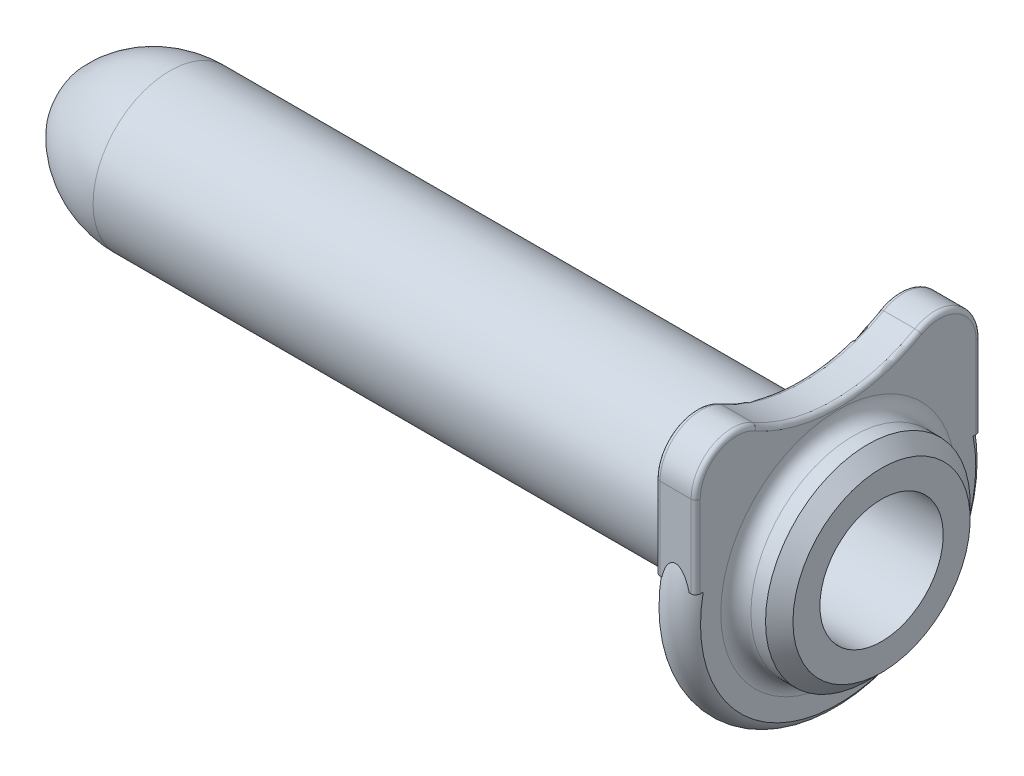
ISO-10303-21;
HEADER;
FILE_DESCRIPTION(('STEP AP214'),'2;1');
FILE_NAME('part.step','',(''),(''),'','','');
FILE_SCHEMA(('AUTOMOTIVE_DESIGN { 1 0 10303 214 1 1 1 1 }'));
ENDSEC;
DATA;
#1=APPLICATION_CONTEXT('core data for automotive mechanical design processes');
#2=APPLICATION_PROTOCOL_DEFINITION('international standard','automotive_design',2000,#1);
#3=PRODUCT_CONTEXT('',#1,'mechanical');
#4=PRODUCT('Part','Part','',(#3));
#5=PRODUCT_RELATED_PRODUCT_CATEGORY('part','',(#4));
#6=PRODUCT_DEFINITION_FORMATION('','',#4);
#7=PRODUCT_DEFINITION_CONTEXT('part definition',#1,'design');
#8=PRODUCT_DEFINITION('design','',#6,#7);
#9=PRODUCT_DEFINITION_SHAPE('','',#8);
#10=(LENGTH_UNIT() NAMED_UNIT(*) SI_UNIT(.MILLI.,.METRE.));
#11=(NAMED_UNIT(*) PLANE_ANGLE_UNIT() SI_UNIT($,.RADIAN.));
#12=(NAMED_UNIT(*) SI_UNIT($,.STERADIAN.) SOLID_ANGLE_UNIT());
#13=UNCERTAINTY_MEASURE_WITH_UNIT(LENGTH_MEASURE(1.E-05),#10,'distance_accuracy_value','');
#14=(GEOMETRIC_REPRESENTATION_CONTEXT(3) GLOBAL_UNCERTAINTY_ASSIGNED_CONTEXT((#13)) GLOBAL_UNIT_ASSIGNED_CONTEXT((#10,
#11,#12)) REPRESENTATION_CONTEXT('',''));
#15=CARTESIAN_POINT('',(0.,0.,0.));
#16=DIRECTION('',(0.,0.,1.));
#17=DIRECTION('',(1.,0.,0.));
#18=AXIS2_PLACEMENT_3D('',#15,#16,#17);
#19=CARTESIAN_POINT('',(40.7924,0.,0.));
#20=DIRECTION('',(-1.,0.,0.));
#21=DIRECTION('',(0.,0.,1.));
#22=AXIS2_PLACEMENT_3D('',#19,#20,#21);
#23=TOROIDAL_SURFACE('',#22,7.0485,1.27);
#24=CARTESIAN_POINT('',(39.877709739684,1.49786852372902,-7.7867892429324));
#25=CARTESIAN_POINT('',(39.8275783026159,1.49786852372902,-7.73378409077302));
#26=CARTESIAN_POINT('',(39.7819469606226,1.49786852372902,-7.67644038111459));
#27=CARTESIAN_POINT('',(39.7009712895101,1.49786852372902,-7.55482523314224));
#28=CARTESIAN_POINT('',(39.6656418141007,1.49786852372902,-7.49054397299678));
#29=CARTESIAN_POINT('',(39.6062610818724,1.49786852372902,-7.35706522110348));
#30=CARTESIAN_POINT('',(39.5821953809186,1.49786852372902,-7.2878741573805));
#31=CARTESIAN_POINT('',(39.5458526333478,1.49786852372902,-7.14648967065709));
#32=CARTESIAN_POINT('',(39.5335726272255,1.49786852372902,-7.07429700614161));
#33=CARTESIAN_POINT('',(39.5209512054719,1.49786852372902,-6.92786628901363));
#34=CARTESIAN_POINT('',(39.5207776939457,1.49786852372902,-6.85361375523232));
#35=CARTESIAN_POINT('',(39.5327435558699,1.49786852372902,-6.70610149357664));
#36=CARTESIAN_POINT('',(39.5448845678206,1.49786852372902,-6.63284189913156));
#37=CARTESIAN_POINT('',(39.5813520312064,1.49786852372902,-6.48850565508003));
#38=CARTESIAN_POINT('',(39.6058190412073,1.49786852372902,-6.41746446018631));
#39=CARTESIAN_POINT('',(39.6663644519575,1.49786852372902,-6.28050888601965));
#40=CARTESIAN_POINT('',(39.7024431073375,1.49786852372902,-6.214594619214));
#41=CARTESIAN_POINT('',(39.7851495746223,1.49786852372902,-6.09003604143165));
#42=CARTESIAN_POINT('',(39.8317448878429,1.49786852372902,-6.0313701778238));
#43=CARTESIAN_POINT('',(39.9343186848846,1.49786852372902,-5.92290383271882));
#44=CARTESIAN_POINT('',(39.9902961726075,1.49786852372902,-5.87310241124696));
#45=CARTESIAN_POINT('',(40.1088029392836,1.49786852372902,-5.7849791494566));
#46=CARTESIAN_POINT('',(40.1711663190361,1.49786852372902,-5.7464343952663));
#47=CARTESIAN_POINT('',(40.3016396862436,1.49786852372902,-5.68075841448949));
#48=CARTESIAN_POINT('',(40.3697484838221,1.49786852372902,-5.65362483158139));
#49=CARTESIAN_POINT('',(40.5074737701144,1.49786852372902,-5.6124269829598));
#50=CARTESIAN_POINT('',(40.5769753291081,1.49786852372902,-5.59797823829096));
#51=CARTESIAN_POINT('',(40.7174245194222,1.49786852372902,-5.58124623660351));
#52=CARTESIAN_POINT('',(40.7883719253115,1.49786852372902,-5.57896109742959));
#53=CARTESIAN_POINT('',(40.9280476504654,1.49786852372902,-5.58655212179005));
#54=CARTESIAN_POINT('',(40.9967905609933,1.49786852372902,-5.59616332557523));
#55=CARTESIAN_POINT('',(41.1316921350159,1.49786852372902,-5.62675880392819));
#56=CARTESIAN_POINT('',(41.1978508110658,1.49786852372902,-5.64774302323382));
#57=CARTESIAN_POINT('',(41.32597471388,1.49786852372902,-5.70045415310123));
#58=CARTESIAN_POINT('',(41.3879261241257,1.49786852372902,-5.73221458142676));
#59=CARTESIAN_POINT('',(41.5057955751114,1.49786852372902,-5.80543954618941));
#60=CARTESIAN_POINT('',(41.5617129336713,1.49786852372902,-5.84690517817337));
#61=CARTESIAN_POINT('',(41.6674534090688,1.49786852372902,-5.93945155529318));
#62=CARTESIAN_POINT('',(41.7170873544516,1.49786852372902,-5.99074834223));
#63=CARTESIAN_POINT('',(41.8073497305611,1.49786852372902,-6.10073076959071));
#64=CARTESIAN_POINT('',(41.8479767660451,1.49786852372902,-6.15941755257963));
#65=CARTESIAN_POINT('',(41.9203450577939,1.49786852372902,-6.28443630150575));
#66=CARTESIAN_POINT('',(41.9517787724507,1.49786852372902,-6.35094639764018));
#67=CARTESIAN_POINT('',(42.0032761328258,1.49786852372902,-6.48823317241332));
#68=CARTESIAN_POINT('',(42.0233384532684,1.49786852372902,-6.55901034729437));
#69=CARTESIAN_POINT('',(42.0518431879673,1.49786852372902,-6.70427810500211));
#70=CARTESIAN_POINT('',(42.0600563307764,1.49786852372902,-6.77881379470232));
#71=CARTESIAN_POINT('',(42.0638748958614,1.49786852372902,-6.9282108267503));
#72=CARTESIAN_POINT('',(42.059479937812,1.49786852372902,-7.00307217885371));
#73=CARTESIAN_POINT('',(42.0381217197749,1.49786852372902,-7.15108861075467));
#74=CARTESIAN_POINT('',(42.0211415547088,1.49786852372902,-7.22424125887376));
#75=CARTESIAN_POINT('',(41.9749817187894,1.49786852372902,-7.36659433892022));
#76=CARTESIAN_POINT('',(41.9458027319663,1.49786852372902,-7.43579499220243));
#77=CARTESIAN_POINT('',(41.8764396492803,1.49786852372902,-7.56731180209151));
#78=CARTESIAN_POINT('',(41.8364013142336,1.49786852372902,-7.62970479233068));
#79=CARTESIAN_POINT('',(41.7462291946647,1.49786852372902,-7.74671412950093));
#80=CARTESIAN_POINT('',(41.6960964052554,1.49786852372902,-7.80133124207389));
#81=CARTESIAN_POINT('',(41.5881725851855,1.49786852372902,-7.90013867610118));
#82=CARTESIAN_POINT('',(41.53054373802,1.49786852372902,-7.94450614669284));
#83=CARTESIAN_POINT('',(41.4085471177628,1.49786852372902,-8.02273368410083));
#84=CARTESIAN_POINT('',(41.3441800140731,1.49786852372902,-8.05659479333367));
#85=CARTESIAN_POINT('',(41.2117368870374,1.49786852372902,-8.11225080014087));
#86=CARTESIAN_POINT('',(41.1437442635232,1.49786852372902,-8.13424425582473));
#87=CARTESIAN_POINT('',(41.0050148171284,1.49786852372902,-8.16636290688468));
#88=CARTESIAN_POINT('',(40.9342783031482,1.49786852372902,-8.17648943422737));
#89=CARTESIAN_POINT('',(40.7928925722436,1.49786852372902,-8.18451539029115));
#90=CARTESIAN_POINT('',(40.7222508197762,1.49786852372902,-8.18254698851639));
#91=CARTESIAN_POINT('',(40.5822877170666,1.49786852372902,-8.16675006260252));
#92=CARTESIAN_POINT('',(40.5129666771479,1.49786852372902,-8.15291878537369));
#93=CARTESIAN_POINT('',(40.3777349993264,1.49786852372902,-8.11385243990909));
#94=CARTESIAN_POINT('',(40.3118196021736,1.49786852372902,-8.08863379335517));
#95=CARTESIAN_POINT('',(40.1851781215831,1.49786852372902,-8.02757641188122));
#96=CARTESIAN_POINT('',(40.1244458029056,1.49786852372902,-7.99175067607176));
#97=CARTESIAN_POINT('',(40.0329503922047,1.49786852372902,-7.92698680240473));
#98=CARTESIAN_POINT('',(39.9999823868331,1.49786852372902,-7.90110204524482));
#99=CARTESIAN_POINT('',(39.9367518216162,1.49786852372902,-7.84621787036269));
#100=CARTESIAN_POINT('',(39.9064892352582,1.49786852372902,-7.81721848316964));
#101=CARTESIAN_POINT('',(39.877709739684,1.49786852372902,-7.7867892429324));
#102=B_SPLINE_CURVE_WITH_KNOTS('',3,(#24,#25,#26,#27,#28,#29,#30,#31,#32,#33,#34,#35,#36,#37,
#38,#39,#40,#41,#42,#43,#44,#45,#46,#47,#48,#49,#50,#51,#52,#53,#54,#55,#56,#57,#58,#59,#60,#61,
#62,#63,#64,#65,#66,#67,#68,#69,#70,#71,#72,#73,#74,#75,#76,#77,#78,#79,#80,#81,#82,#83,#84,#85,
#86,#87,#88,#89,#90,#91,#92,#93,#94,#95,#96,#97,#98,#99,#100,#101),.UNSPECIFIED.,.T.,.F.,(4,2,2,
2,2,2,2,2,2,2,2,2,2,2,2,2,2,2,2,2,2,2,2,2,2,2,2,2,2,2,2,2,2,2,2,2,2,2,4),(0.,0.218714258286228,
0.437742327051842,0.656488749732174,0.875180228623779,1.09690412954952,1.31865753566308,
1.54299895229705,1.76734528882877,1.9910076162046,2.21464621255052,2.4334975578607,
2.65230368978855,2.86422284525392,3.07610920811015,3.2833601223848,3.49061002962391,
3.69851055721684,3.90643456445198,4.11960028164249,4.33279899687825,4.55247647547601,
4.77217955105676,4.9960791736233,5.21998555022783,5.44419323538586,5.66838835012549,
5.88971157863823,6.11101299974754,6.3281426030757,6.54525065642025,6.75860379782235,
6.97193298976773,7.18293516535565,7.39398632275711,7.60473409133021,7.81522464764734,
7.94078553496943,8.06634519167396),.UNSPECIFIED.);
#103=CARTESIAN_POINT('',(41.91,1.49786852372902,-7.50367619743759));
#104=VERTEX_POINT('',#103);
#105=CARTESIAN_POINT('',(41.5535805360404,1.49786852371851,-7.9248));
#106=VERTEX_POINT('',#105);
#107=EDGE_CURVE('E156',#104,#106,#102,.T.);
#108=ORIENTED_EDGE('',*,*,#107,.F.);
#109=CARTESIAN_POINT('',(41.91,0.,0.));
#110=DIRECTION('',(-1.,0.,0.));
#111=DIRECTION('',(0.,0.,1.));
#112=AXIS2_PLACEMENT_3D('',#109,#110,#111);
#113=CIRCLE('',#112,7.65171657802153);
#114=CARTESIAN_POINT('',(41.91,1.49786852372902,7.50367619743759));
#115=VERTEX_POINT('',#114);
#116=EDGE_CURVE('E165',#104,#115,#113,.T.);
#117=ORIENTED_EDGE('',*,*,#116,.T.);
#118=CARTESIAN_POINT('',(39.877709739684,1.49786852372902,7.7867892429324));
#119=CARTESIAN_POINT('',(39.8275783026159,1.49786852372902,7.73378409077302));
#120=CARTESIAN_POINT('',(39.7819469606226,1.49786852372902,7.67644038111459));
#121=CARTESIAN_POINT('',(39.7009712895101,1.49786852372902,7.55482523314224));
#122=CARTESIAN_POINT('',(39.6656418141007,1.49786852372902,7.49054397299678));
#123=CARTESIAN_POINT('',(39.6062610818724,1.49786852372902,7.35706522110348));
#124=CARTESIAN_POINT('',(39.5821953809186,1.49786852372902,7.2878741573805));
#125=CARTESIAN_POINT('',(39.5458526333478,1.49786852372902,7.14648967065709));
#126=CARTESIAN_POINT('',(39.5335726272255,1.49786852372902,7.07429700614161));
#127=CARTESIAN_POINT('',(39.5209512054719,1.49786852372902,6.92786628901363));
#128=CARTESIAN_POINT('',(39.5207776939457,1.49786852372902,6.85361375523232));
#129=CARTESIAN_POINT('',(39.5327435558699,1.49786852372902,6.70610149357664));
#130=CARTESIAN_POINT('',(39.5448845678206,1.49786852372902,6.63284189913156));
#131=CARTESIAN_POINT('',(39.5813520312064,1.49786852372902,6.48850565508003));
#132=CARTESIAN_POINT('',(39.6058190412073,1.49786852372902,6.41746446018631));
#133=CARTESIAN_POINT('',(39.6663644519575,1.49786852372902,6.28050888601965));
#134=CARTESIAN_POINT('',(39.7024431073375,1.49786852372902,6.214594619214));
#135=CARTESIAN_POINT('',(39.7851495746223,1.49786852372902,6.09003604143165));
#136=CARTESIAN_POINT('',(39.8317448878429,1.49786852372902,6.0313701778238));
#137=CARTESIAN_POINT('',(39.9343186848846,1.49786852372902,5.92290383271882));
#138=CARTESIAN_POINT('',(39.9902961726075,1.49786852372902,5.87310241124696));
#139=CARTESIAN_POINT('',(40.1088029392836,1.49786852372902,5.7849791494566));
#140=CARTESIAN_POINT('',(40.1711663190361,1.49786852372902,5.7464343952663));
#141=CARTESIAN_POINT('',(40.3016396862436,1.49786852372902,5.68075841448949));
#142=CARTESIAN_POINT('',(40.3697484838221,1.49786852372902,5.65362483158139));
#143=CARTESIAN_POINT('',(40.5074737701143,1.49786852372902,5.6124269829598));
#144=CARTESIAN_POINT('',(40.5769753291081,1.49786852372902,5.59797823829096));
#145=CARTESIAN_POINT('',(40.7174245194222,1.49786852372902,5.58124623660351));
#146=CARTESIAN_POINT('',(40.7883719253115,1.49786852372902,5.57896109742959));
#147=CARTESIAN_POINT('',(40.9280476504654,1.49786852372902,5.58655212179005));
#148=CARTESIAN_POINT('',(40.9967905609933,1.49786852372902,5.59616332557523));
#149=CARTESIAN_POINT('',(41.1316921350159,1.49786852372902,5.62675880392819));
#150=CARTESIAN_POINT('',(41.1978508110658,1.49786852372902,5.64774302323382));
#151=CARTESIAN_POINT('',(41.32597471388,1.49786852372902,5.70045415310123));
#152=CARTESIAN_POINT('',(41.3879261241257,1.49786852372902,5.73221458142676));
#153=CARTESIAN_POINT('',(41.5057955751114,1.49786852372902,5.80543954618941));
#154=CARTESIAN_POINT('',(41.5617129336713,1.49786852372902,5.84690517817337));
#155=CARTESIAN_POINT('',(41.6674534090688,1.49786852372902,5.93945155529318));
#156=CARTESIAN_POINT('',(41.7170873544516,1.49786852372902,5.99074834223));
#157=CARTESIAN_POINT('',(41.8073497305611,1.49786852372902,6.10073076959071));
#158=CARTESIAN_POINT('',(41.8479767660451,1.49786852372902,6.15941755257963));
#159=CARTESIAN_POINT('',(41.9203450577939,1.49786852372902,6.28443630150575));
#160=CARTESIAN_POINT('',(41.9517787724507,1.49786852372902,6.35094639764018));
#161=CARTESIAN_POINT('',(42.0032761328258,1.49786852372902,6.48823317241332));
#162=CARTESIAN_POINT('',(42.0233384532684,1.49786852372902,6.55901034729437));
#163=CARTESIAN_POINT('',(42.0518431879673,1.49786852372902,6.70427810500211));
#164=CARTESIAN_POINT('',(42.0600563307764,1.49786852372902,6.77881379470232));
#165=CARTESIAN_POINT('',(42.0638748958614,1.49786852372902,6.9282108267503));
#166=CARTESIAN_POINT('',(42.059479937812,1.49786852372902,7.00307217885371));
#167=CARTESIAN_POINT('',(42.0381217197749,1.49786852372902,7.15108861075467));
#168=CARTESIAN_POINT('',(42.0211415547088,1.49786852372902,7.22424125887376));
#169=CARTESIAN_POINT('',(41.9749817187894,1.49786852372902,7.36659433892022));
#170=CARTESIAN_POINT('',(41.9458027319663,1.49786852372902,7.43579499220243));
#171=CARTESIAN_POINT('',(41.8764396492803,1.49786852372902,7.56731180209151));
#172=CARTESIAN_POINT('',(41.8364013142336,1.49786852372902,7.62970479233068));
#173=CARTESIAN_POINT('',(41.7462291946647,1.49786852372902,7.74671412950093));
#174=CARTESIAN_POINT('',(41.6960964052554,1.49786852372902,7.80133124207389));
#175=CARTESIAN_POINT('',(41.5881725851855,1.49786852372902,7.90013867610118));
#176=CARTESIAN_POINT('',(41.53054373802,1.49786852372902,7.94450614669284));
#177=CARTESIAN_POINT('',(41.4085471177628,1.49786852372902,8.02273368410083));
#178=CARTESIAN_POINT('',(41.3441800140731,1.49786852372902,8.05659479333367));
#179=CARTESIAN_POINT('',(41.2117368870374,1.49786852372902,8.11225080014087));
#180=CARTESIAN_POINT('',(41.1437442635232,1.49786852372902,8.13424425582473));
#181=CARTESIAN_POINT('',(41.0050148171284,1.49786852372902,8.16636290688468));
#182=CARTESIAN_POINT('',(40.9342783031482,1.49786852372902,8.17648943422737));
#183=CARTESIAN_POINT('',(40.7928925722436,1.49786852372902,8.18451539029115));
#184=CARTESIAN_POINT('',(40.7222508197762,1.49786852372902,8.18254698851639));
#185=CARTESIAN_POINT('',(40.5822877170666,1.49786852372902,8.16675006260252));
#186=CARTESIAN_POINT('',(40.5129666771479,1.49786852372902,8.15291878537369));
#187=CARTESIAN_POINT('',(40.3777349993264,1.49786852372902,8.11385243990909));
#188=CARTESIAN_POINT('',(40.3118196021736,1.49786852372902,8.08863379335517));
#189=CARTESIAN_POINT('',(40.1851781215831,1.49786852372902,8.02757641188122));
#190=CARTESIAN_POINT('',(40.1244458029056,1.49786852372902,7.99175067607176));
#191=CARTESIAN_POINT('',(40.0329503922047,1.49786852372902,7.92698680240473));
#192=CARTESIAN_POINT('',(39.9999823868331,1.49786852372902,7.90110204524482));
#193=CARTESIAN_POINT('',(39.9367518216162,1.49786852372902,7.84621787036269));
#194=CARTESIAN_POINT('',(39.9064892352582,1.49786852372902,7.81721848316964));
#195=CARTESIAN_POINT('',(39.877709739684,1.49786852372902,7.7867892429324));
#196=B_SPLINE_CURVE_WITH_KNOTS('',3,(#118,#119,#120,#121,#122,#123,#124,#125,#126,#127,#128,
#129,#130,#131,#132,#133,#134,#135,#136,#137,#138,#139,#140,#141,#142,#143,#144,#145,#146,#147,
#148,#149,#150,#151,#152,#153,#154,#155,#156,#157,#158,#159,#160,#161,#162,#163,#164,#165,#166,
#167,#168,#169,#170,#171,#172,#173,#174,#175,#176,#177,#178,#179,#180,#181,#182,#183,#184,#185,
#186,#187,#188,#189,#190,#191,#192,#193,#194,#195),.UNSPECIFIED.,.T.,.F.,(4,2,2,2,2,2,2,2,2,2,2,
2,2,2,2,2,2,2,2,2,2,2,2,2,2,2,2,2,2,2,2,2,2,2,2,2,2,2,4),(0.,0.218714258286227,
0.437742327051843,0.656488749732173,0.87518022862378,1.09690412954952,1.31865753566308,
1.54299895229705,1.76734528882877,1.9910076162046,2.21464621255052,2.4334975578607,
2.65230368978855,2.8642228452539,3.07610920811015,3.28336012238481,3.49061002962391,
3.69851055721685,3.90643456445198,4.11960028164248,4.33279899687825,4.55247647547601,
4.77217955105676,4.9960791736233,5.21998555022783,5.44419323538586,5.66838835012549,
5.88971157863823,6.11101299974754,6.3281426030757,6.54525065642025,6.75860379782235,
6.97193298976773,7.18293516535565,7.39398632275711,7.60473409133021,7.81522464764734,
7.94078553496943,8.06634519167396),.UNSPECIFIED.);
#197=CARTESIAN_POINT('',(41.5535805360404,1.49786852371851,7.9248));
#198=VERTEX_POINT('',#197);
#199=EDGE_CURVE('E221',#115,#198,#196,.T.);
#200=ORIENTED_EDGE('',*,*,#199,.T.);
#201=CARTESIAN_POINT('',(40.7924,2.52883119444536,7.9248));
#202=CARTESIAN_POINT('',(40.767936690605,2.5288277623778,7.9248));
#203=CARTESIAN_POINT('',(40.7434331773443,2.5264765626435,7.9248));
#204=CARTESIAN_POINT('',(40.6952476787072,2.51733181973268,7.9248));
#205=CARTESIAN_POINT('',(40.6715680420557,2.51052652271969,7.9248));
#206=CARTESIAN_POINT('',(40.6258799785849,2.49323528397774,7.9248));
#207=CARTESIAN_POINT('',(40.603857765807,2.48278506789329,7.9248));
#208=CARTESIAN_POINT('',(40.5614956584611,2.4589577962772,7.9248));
#209=CARTESIAN_POINT('',(40.5411557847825,2.4455807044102,7.9248));
#210=CARTESIAN_POINT('',(40.4869367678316,2.40524823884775,7.9248));
#211=CARTESIAN_POINT('',(40.4548859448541,2.37584611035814,7.9248));
#212=CARTESIAN_POINT('',(40.395486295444,2.31261342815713,7.9248));
#213=CARTESIAN_POINT('',(40.3681547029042,2.27876740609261,7.9248));
#214=CARTESIAN_POINT('',(40.3182188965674,2.20936770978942,7.9248));
#215=CARTESIAN_POINT('',(40.2954949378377,2.17389882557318,7.9248));
#216=CARTESIAN_POINT('',(40.2531055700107,2.10116297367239,7.9248));
#217=CARTESIAN_POINT('',(40.2334432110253,2.06389426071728,7.9248));
#218=CARTESIAN_POINT('',(40.1782151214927,1.9501302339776,7.9248));
#219=CARTESIAN_POINT('',(40.1464770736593,1.87178066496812,7.9248));
#220=CARTESIAN_POINT('',(40.0971633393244,1.73174594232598,7.9248));
#221=CARTESIAN_POINT('',(40.0780171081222,1.67058028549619,7.9248));
#222=CARTESIAN_POINT('',(40.0432137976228,1.54725579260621,7.9248));
#223=CARTESIAN_POINT('',(40.0275571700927,1.48509682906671,7.9248));
#224=CARTESIAN_POINT('',(39.984849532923,1.29742019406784,7.9248));
#225=CARTESIAN_POINT('',(39.9621325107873,1.17092251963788,7.9248));
#226=CARTESIAN_POINT('',(39.9251465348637,0.916366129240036,7.9248));
#227=CARTESIAN_POINT('',(39.9109048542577,0.788303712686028,7.9248));
#228=CARTESIAN_POINT('',(39.8893277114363,0.531580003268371,7.9248));
#229=CARTESIAN_POINT('',(39.8819940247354,0.402918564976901,7.9248));
#230=CARTESIAN_POINT('',(39.8729624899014,0.131787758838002,7.9248));
#231=CARTESIAN_POINT('',(39.8719422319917,-0.0107037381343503,7.9248));
#232=CARTESIAN_POINT('',(39.8772089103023,-0.295661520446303,7.9248));
#233=CARTESIAN_POINT('',(39.8835015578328,-0.438127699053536,7.9248));
#234=CARTESIAN_POINT('',(39.9042542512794,-0.722767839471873,7.9248));
#235=CARTESIAN_POINT('',(39.9187287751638,-0.864940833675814,7.9248));
#236=CARTESIAN_POINT('',(39.9481517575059,-1.07704672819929,7.9248));
#237=CARTESIAN_POINT('',(39.9592366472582,-1.14751911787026,7.9248));
#238=CARTESIAN_POINT('',(39.9844220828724,-1.28791788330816,7.9248));
#239=CARTESIAN_POINT('',(39.9985220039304,-1.35784436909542,7.9248));
#240=CARTESIAN_POINT('',(40.0305267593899,-1.49777847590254,7.9248));
#241=CARTESIAN_POINT('',(40.0484781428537,-1.56777560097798,7.9248));
#242=CARTESIAN_POINT('',(40.0889687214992,-1.70657016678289,7.9248));
#243=CARTESIAN_POINT('',(40.111514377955,-1.77536576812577,7.9248));
#244=CARTESIAN_POINT('',(40.1621655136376,-1.91010165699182,7.9248));
#245=CARTESIAN_POINT('',(40.1902112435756,-1.97606407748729,7.9248));
#246=CARTESIAN_POINT('',(40.2537605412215,-2.10422474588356,7.9248));
#247=CARTESIAN_POINT('',(40.2892385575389,-2.16643497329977,7.9248));
#248=CARTESIAN_POINT('',(40.3521280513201,-2.25738566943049,7.9248));
#249=CARTESIAN_POINT('',(40.3759692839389,-2.2885749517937,7.9248));
#250=CARTESIAN_POINT('',(40.4273821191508,-2.34778984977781,7.9248));
#251=CARTESIAN_POINT('',(40.4549518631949,-2.37581702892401,7.9248));
#252=CARTESIAN_POINT('',(40.5070193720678,-2.42065609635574,7.9248));
#253=CARTESIAN_POINT('',(40.5305936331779,-2.43852818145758,7.9248));
#254=CARTESIAN_POINT('',(40.5802481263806,-2.47039582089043,7.9248));
#255=CARTESIAN_POINT('',(40.6063238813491,-2.48439813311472,7.9248));
#256=CARTESIAN_POINT('',(40.6546932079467,-2.50470400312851,7.9248));
#257=CARTESIAN_POINT('',(40.6765560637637,-2.51202372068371,7.9248));
#258=CARTESIAN_POINT('',(40.7211981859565,-2.52290685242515,7.9248));
#259=CARTESIAN_POINT('',(40.7439765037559,-2.52647405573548,7.9248));
#260=CARTESIAN_POINT('',(40.7898894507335,-2.52950803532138,7.9248));
#261=CARTESIAN_POINT('',(40.8130250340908,-2.52896070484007,7.9248));
#262=CARTESIAN_POINT('',(40.8588375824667,-2.52378984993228,7.9248));
#263=CARTESIAN_POINT('',(40.8815142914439,-2.51916411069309,7.9248));
#264=CARTESIAN_POINT('',(40.9249174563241,-2.50653904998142,7.9248));
#265=CARTESIAN_POINT('',(40.9456855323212,-2.49867943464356,7.9248));
#266=CARTESIAN_POINT('',(40.9859234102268,-2.48017561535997,7.9248));
#267=CARTESIAN_POINT('',(41.0053927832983,-2.46953049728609,7.9248));
#268=CARTESIAN_POINT('',(41.056288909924,-2.43764277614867,7.9248));
#269=CARTESIAN_POINT('',(41.0863652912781,-2.41424954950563,7.9248));
#270=CARTESIAN_POINT('',(41.1426151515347,-2.36315884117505,7.9248));
#271=CARTESIAN_POINT('',(41.1687750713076,-2.33544705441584,7.9248));
#272=CARTESIAN_POINT('',(41.238082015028,-2.25298235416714,7.9248));
#273=CARTESIAN_POINT('',(41.2772468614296,-2.19491896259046,7.9248));
#274=CARTESIAN_POINT('',(41.3472679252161,-2.07409501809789,7.9248));
#275=CARTESIAN_POINT('',(41.3781033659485,-2.01132320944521,7.9248));
#276=CARTESIAN_POINT('',(41.4456721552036,-1.85515428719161,7.9248));
#277=CARTESIAN_POINT('',(41.4791065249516,-1.76034729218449,7.9248));
#278=CARTESIAN_POINT('',(41.5370412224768,-1.56798152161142,7.9248));
#279=CARTESIAN_POINT('',(41.5615222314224,-1.47041727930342,7.9248));
#280=CARTESIAN_POINT('',(41.6038374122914,-1.27326990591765,7.9248));
#281=CARTESIAN_POINT('',(41.6216307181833,-1.17367816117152,7.9248));
#282=CARTESIAN_POINT('',(41.6517774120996,-0.973797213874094,7.9248));
#283=CARTESIAN_POINT('',(41.6641357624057,-0.873508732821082,7.9248));
#284=CARTESIAN_POINT('',(41.6904810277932,-0.611821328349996,7.9248));
#285=CARTESIAN_POINT('',(41.7009500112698,-0.450067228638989,7.9248));
#286=CARTESIAN_POINT('',(41.7122879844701,-0.126116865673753,7.9248));
#287=CARTESIAN_POINT('',(41.7131480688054,0.0360796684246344,7.9248));
#288=CARTESIAN_POINT('',(41.7054141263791,0.359321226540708,7.9248));
#289=CARTESIAN_POINT('',(41.696876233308,0.520367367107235,7.9248));
#290=CARTESIAN_POINT('',(41.6759003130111,0.761140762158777,7.9248));
#291=CARTESIAN_POINT('',(41.6675521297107,0.84123190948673,7.9248));
#292=CARTESIAN_POINT('',(41.6477330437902,1.00102226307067,7.9248));
#293=CARTESIAN_POINT('',(41.6362625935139,1.08072152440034,7.9248));
#294=CARTESIAN_POINT('',(41.6092014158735,1.24223857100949,7.9248));
#295=CARTESIAN_POINT('',(41.5934831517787,1.3240355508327,7.9248));
#296=CARTESIAN_POINT('',(41.5571950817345,1.48676032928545,7.9248));
#297=CARTESIAN_POINT('',(41.5366135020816,1.56768551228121,7.9248));
#298=CARTESIAN_POINT('',(41.4854079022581,1.74109208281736,7.9248));
#299=CARTESIAN_POINT('',(41.4536857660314,1.83327027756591,7.9248));
#300=CARTESIAN_POINT('',(41.3974187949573,1.96774176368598,7.9248));
#301=CARTESIAN_POINT('',(41.3772559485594,2.01186375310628,7.9248));
#302=CARTESIAN_POINT('',(41.3333867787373,2.09829140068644,7.9248));
#303=CARTESIAN_POINT('',(41.309684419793,2.14059902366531,7.9248));
#304=CARTESIAN_POINT('',(41.2642763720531,2.21238291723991,7.9248));
#305=CARTESIAN_POINT('',(41.2435167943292,2.24245299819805,7.9248));
#306=CARTESIAN_POINT('',(41.1990106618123,2.30040773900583,7.9248));
#307=CARTESIAN_POINT('',(41.1752598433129,2.32828918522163,7.9248));
#308=CARTESIAN_POINT('',(41.123999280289,2.38107599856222,7.9248));
#309=CARTESIAN_POINT('',(41.0964480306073,2.40594184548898,7.9248));
#310=CARTESIAN_POINT('',(41.037423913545,2.45052163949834,7.9248));
#311=CARTESIAN_POINT('',(41.0059639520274,2.47025190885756,7.9248));
#312=CARTESIAN_POINT('',(40.9514522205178,2.49637070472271,7.9248));
#313=CARTESIAN_POINT('',(40.9294787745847,2.50500344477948,7.9248));
#314=CARTESIAN_POINT('',(40.8844248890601,2.51849678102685,7.9248));
#315=CARTESIAN_POINT('',(40.8613479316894,2.52336850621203,7.9248));
#316=CARTESIAN_POINT('',(40.8304764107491,2.52702795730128,7.9248));
#317=CARTESIAN_POINT('',(40.8228787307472,2.52770276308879,7.9248));
#318=CARTESIAN_POINT('',(40.8076553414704,2.52860496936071,7.9248));
#319=CARTESIAN_POINT('',(40.8000296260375,2.52883226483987,7.9248));
#320=CARTESIAN_POINT('',(40.7924,2.52883119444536,7.9248));
#321=B_SPLINE_CURVE_WITH_KNOTS('',3,(#201,#202,#203,#204,#205,#206,#207,#208,#209,#210,#211,
#212,#213,#214,#215,#216,#217,#218,#219,#220,#221,#222,#223,#224,#225,#226,#227,#228,#229,#230,
#231,#232,#233,#234,#235,#236,#237,#238,#239,#240,#241,#242,#243,#244,#245,#246,#247,#248,#249,
#250,#251,#252,#253,#254,#255,#256,#257,#258,#259,#260,#261,#262,#263,#264,#265,#266,#267,#268,
#269,#270,#271,#272,#273,#274,#275,#276,#277,#278,#279,#280,#281,#282,#283,#284,#285,#286,#287,
#288,#289,#290,#291,#292,#293,#294,#295,#296,#297,#298,#299,#300,#301,#302,#303,#304,#305,#306,
#307,#308,#309,#310,#311,#312,#313,#314,#315,#316,#317,#318,#319,#320),.UNSPECIFIED.,.T.,.F.,(4,
2,2,2,2,2,2,2,2,2,2,2,2,2,2,2,2,2,2,2,2,2,2,2,2,2,2,2,2,2,2,2,2,2,2,2,2,2,2,2,2,2,2,2,2,2,2,2,2,
2,2,2,2,2,2,2,2,2,2,4),(0.,0.0733549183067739,0.146904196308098,0.219751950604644,
0.29260060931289,0.422327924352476,0.55251939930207,0.678698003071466,0.805001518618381,
1.05797809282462,1.2501676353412,1.44238204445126,1.82750121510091,2.21385306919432,
2.60030419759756,3.02760033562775,3.45523041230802,3.88361956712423,4.0975858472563,
4.31150783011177,4.52817772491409,4.74515446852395,4.9598930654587,5.17390518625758,
5.29146949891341,5.40897542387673,5.49745426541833,5.58577760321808,5.65466143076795,
5.72347563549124,5.79252587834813,5.86161364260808,5.92798662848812,5.99438142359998,
6.10802464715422,6.22205264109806,6.43098166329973,6.64042711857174,6.94127827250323,
7.24277480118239,7.5460848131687,7.84911731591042,8.33502327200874,8.82137952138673,
9.30484647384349,9.5463738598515,9.7878662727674,10.0376205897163,10.2879858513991,
10.5797731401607,10.7251910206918,10.8704472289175,10.9799265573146,11.0895637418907,
11.2005103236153,11.3110998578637,11.3816602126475,11.4520109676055,11.4748835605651,
11.4977615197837),.UNSPECIFIED.);
#322=CARTESIAN_POINT('',(40.0312194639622,1.49786852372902,7.9248));
#323=VERTEX_POINT('',#322);
#324=EDGE_CURVE('E253',#198,#323,#321,.T.);
#325=ORIENTED_EDGE('',*,*,#324,.T.);
#326=CARTESIAN_POINT('',(39.6748,1.49786852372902,7.50367619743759));
#327=VERTEX_POINT('',#326);
#328=EDGE_CURVE('E215',#323,#327,#196,.T.);
#329=ORIENTED_EDGE('',*,*,#328,.T.);
#330=CARTESIAN_POINT('',(39.6748,0.,0.));
#331=DIRECTION('',(-1.,0.,0.));
#332=DIRECTION('',(0.,0.,1.));
#333=AXIS2_PLACEMENT_3D('',#330,#331,#332);
#334=CIRCLE('',#333,7.65171657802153);
#335=CARTESIAN_POINT('',(39.6748,1.49786852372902,-7.50367619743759));
#336=VERTEX_POINT('',#335);
#337=EDGE_CURVE('E171',#336,#327,#334,.T.);
#338=ORIENTED_EDGE('',*,*,#337,.F.);
#339=CARTESIAN_POINT('',(40.0312194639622,1.49786852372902,-7.9248));
#340=VERTEX_POINT('',#339);
#341=EDGE_CURVE('E177',#340,#336,#102,.T.);
#342=ORIENTED_EDGE('',*,*,#341,.F.);
#343=CARTESIAN_POINT('',(40.7924,2.52883119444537,-7.9248));
#344=CARTESIAN_POINT('',(40.767936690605,2.5288277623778,-7.9248));
#345=CARTESIAN_POINT('',(40.7434331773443,2.52647656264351,-7.9248));
#346=CARTESIAN_POINT('',(40.6952476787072,2.51733181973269,-7.9248));
#347=CARTESIAN_POINT('',(40.6715680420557,2.51052652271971,-7.9248));
#348=CARTESIAN_POINT('',(40.6258799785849,2.49323528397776,-7.9248));
#349=CARTESIAN_POINT('',(40.603857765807,2.4827850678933,-7.9248));
#350=CARTESIAN_POINT('',(40.561495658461,2.4589577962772,-7.9248));
#351=CARTESIAN_POINT('',(40.5411557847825,2.4455807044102,-7.9248));
#352=CARTESIAN_POINT('',(40.4869367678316,2.40524823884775,-7.9248));
#353=CARTESIAN_POINT('',(40.4548859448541,2.37584611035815,-7.9248));
#354=CARTESIAN_POINT('',(40.395486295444,2.31261342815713,-7.9248));
#355=CARTESIAN_POINT('',(40.3681547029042,2.27876740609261,-7.9248));
#356=CARTESIAN_POINT('',(40.3182188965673,2.20936770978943,-7.9248));
#357=CARTESIAN_POINT('',(40.2954949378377,2.17389882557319,-7.9248));
#358=CARTESIAN_POINT('',(40.2531055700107,2.10116297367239,-7.9248));
#359=CARTESIAN_POINT('',(40.2334432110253,2.06389426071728,-7.9248));
#360=CARTESIAN_POINT('',(40.1782151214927,1.9501302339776,-7.9248));
#361=CARTESIAN_POINT('',(40.1464770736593,1.87178066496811,-7.9248));
#362=CARTESIAN_POINT('',(40.0971633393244,1.73174594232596,-7.9248));
#363=CARTESIAN_POINT('',(40.0780171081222,1.67058028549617,-7.9248));
#364=CARTESIAN_POINT('',(40.0432137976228,1.54725579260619,-7.9248));
#365=CARTESIAN_POINT('',(40.0275571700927,1.48509682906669,-7.9248));
#366=CARTESIAN_POINT('',(39.984849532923,1.29742019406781,-7.9248));
#367=CARTESIAN_POINT('',(39.9621325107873,1.17092251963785,-7.9248));
#368=CARTESIAN_POINT('',(39.9251465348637,0.916366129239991,-7.9248));
#369=CARTESIAN_POINT('',(39.9109048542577,0.788303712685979,-7.9248));
#370=CARTESIAN_POINT('',(39.8893277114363,0.531580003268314,-7.9248));
#371=CARTESIAN_POINT('',(39.8819940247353,0.402918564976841,-7.9248));
#372=CARTESIAN_POINT('',(39.8729624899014,0.131787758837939,-7.9248));
#373=CARTESIAN_POINT('',(39.8719422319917,-0.010703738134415,-7.9248));
#374=CARTESIAN_POINT('',(39.8772089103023,-0.295661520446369,-7.9248));
#375=CARTESIAN_POINT('',(39.8835015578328,-0.438127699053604,-7.9248));
#376=CARTESIAN_POINT('',(39.9042542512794,-0.722767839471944,-7.9248));
#377=CARTESIAN_POINT('',(39.9187287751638,-0.864940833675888,-7.9248));
#378=CARTESIAN_POINT('',(39.9481517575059,-1.07704672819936,-7.9248));
#379=CARTESIAN_POINT('',(39.9592366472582,-1.14751911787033,-7.9248));
#380=CARTESIAN_POINT('',(39.9844220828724,-1.28791788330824,-7.9248));
#381=CARTESIAN_POINT('',(39.9985220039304,-1.3578443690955,-7.9248));
#382=CARTESIAN_POINT('',(40.0305267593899,-1.49777847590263,-7.9248));
#383=CARTESIAN_POINT('',(40.0484781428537,-1.56777560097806,-7.9248));
#384=CARTESIAN_POINT('',(40.0889687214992,-1.70657016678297,-7.9248));
#385=CARTESIAN_POINT('',(40.111514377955,-1.77536576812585,-7.9248));
#386=CARTESIAN_POINT('',(40.1621655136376,-1.9101016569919,-7.9248));
#387=CARTESIAN_POINT('',(40.1902112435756,-1.97606407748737,-7.9248));
#388=CARTESIAN_POINT('',(40.2537605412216,-2.10422474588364,-7.9248));
#389=CARTESIAN_POINT('',(40.2892385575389,-2.16643497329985,-7.9248));
#390=CARTESIAN_POINT('',(40.3521280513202,-2.25738566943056,-7.9248));
#391=CARTESIAN_POINT('',(40.375969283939,-2.28857495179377,-7.9248));
#392=CARTESIAN_POINT('',(40.4273821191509,-2.34778984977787,-7.9248));
#393=CARTESIAN_POINT('',(40.454951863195,-2.37581702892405,-7.9248));
#394=CARTESIAN_POINT('',(40.5070193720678,-2.42065609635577,-7.9248));
#395=CARTESIAN_POINT('',(40.5305936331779,-2.43852818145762,-7.9248));
#396=CARTESIAN_POINT('',(40.5802481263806,-2.47039582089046,-7.9248));
#397=CARTESIAN_POINT('',(40.6063238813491,-2.48439813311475,-7.9248));
#398=CARTESIAN_POINT('',(40.6546932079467,-2.50470400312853,-7.9248));
#399=CARTESIAN_POINT('',(40.6765560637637,-2.51202372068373,-7.9248));
#400=CARTESIAN_POINT('',(40.7211981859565,-2.52290685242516,-7.9248));
#401=CARTESIAN_POINT('',(40.7439765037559,-2.52647405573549,-7.9248));
#402=CARTESIAN_POINT('',(40.7898894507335,-2.52950803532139,-7.9248));
#403=CARTESIAN_POINT('',(40.8130250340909,-2.52896070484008,-7.9248));
#404=CARTESIAN_POINT('',(40.8588375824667,-2.52378984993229,-7.9248));
#405=CARTESIAN_POINT('',(40.8815142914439,-2.5191641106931,-7.9248));
#406=CARTESIAN_POINT('',(40.9249174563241,-2.50653904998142,-7.9248));
#407=CARTESIAN_POINT('',(40.9456855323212,-2.49867943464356,-7.9248));
#408=CARTESIAN_POINT('',(40.9859234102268,-2.48017561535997,-7.9248));
#409=CARTESIAN_POINT('',(41.0053927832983,-2.46953049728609,-7.9248));
#410=CARTESIAN_POINT('',(41.0562889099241,-2.43764277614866,-7.9248));
#411=CARTESIAN_POINT('',(41.0863652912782,-2.41424954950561,-7.9248));
#412=CARTESIAN_POINT('',(41.1426151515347,-2.36315884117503,-7.9248));
#413=CARTESIAN_POINT('',(41.1687750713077,-2.33544705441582,-7.9248));
#414=CARTESIAN_POINT('',(41.238082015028,-2.25298235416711,-7.9248));
#415=CARTESIAN_POINT('',(41.2772468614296,-2.19491896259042,-7.9248));
#416=CARTESIAN_POINT('',(41.3472679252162,-2.07409501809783,-7.9248));
#417=CARTESIAN_POINT('',(41.3781033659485,-2.01132320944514,-7.9248));
#418=CARTESIAN_POINT('',(41.4456721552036,-1.85515428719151,-7.9248));
#419=CARTESIAN_POINT('',(41.4791065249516,-1.76034729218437,-7.9248));
#420=CARTESIAN_POINT('',(41.5370412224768,-1.56798152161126,-7.9248));
#421=CARTESIAN_POINT('',(41.5615222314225,-1.47041727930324,-7.9248));
#422=CARTESIAN_POINT('',(41.6038374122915,-1.27326990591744,-7.9248));
#423=CARTESIAN_POINT('',(41.6216307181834,-1.17367816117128,-7.9248));
#424=CARTESIAN_POINT('',(41.6517774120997,-0.973797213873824,-7.9248));
#425=CARTESIAN_POINT('',(41.6641357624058,-0.873508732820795,-7.9248));
#426=CARTESIAN_POINT('',(41.6904810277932,-0.611821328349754,-7.9248));
#427=CARTESIAN_POINT('',(41.7009500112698,-0.450067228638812,-7.9248));
#428=CARTESIAN_POINT('',(41.7122879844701,-0.126116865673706,-7.9248));
#429=CARTESIAN_POINT('',(41.7131480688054,0.036079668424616,-7.9248));
#430=CARTESIAN_POINT('',(41.7054141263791,0.35932122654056,-7.9248));
#431=CARTESIAN_POINT('',(41.696876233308,0.520367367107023,-7.9248));
#432=CARTESIAN_POINT('',(41.6759003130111,0.76114076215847,-7.9248));
#433=CARTESIAN_POINT('',(41.6675521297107,0.841231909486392,-7.9248));
#434=CARTESIAN_POINT('',(41.6477330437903,1.00102226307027,-7.9248));
#435=CARTESIAN_POINT('',(41.636262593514,1.08072152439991,-7.9248));
#436=CARTESIAN_POINT('',(41.6092014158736,1.24223857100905,-7.9248));
#437=CARTESIAN_POINT('',(41.5934831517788,1.32403555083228,-7.9248));
#438=CARTESIAN_POINT('',(41.5571950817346,1.48676032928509,-7.9248));
#439=CARTESIAN_POINT('',(41.5366135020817,1.56768551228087,-7.9248));
#440=CARTESIAN_POINT('',(41.4854079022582,1.74109208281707,-7.9248));
#441=CARTESIAN_POINT('',(41.4536857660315,1.83327027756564,-7.9248));
#442=CARTESIAN_POINT('',(41.3974187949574,1.96774176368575,-7.9248));
#443=CARTESIAN_POINT('',(41.3772559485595,2.01186375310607,-7.9248));
#444=CARTESIAN_POINT('',(41.3333867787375,2.09829140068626,-7.9248));
#445=CARTESIAN_POINT('',(41.3096844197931,2.14059902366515,-7.9248));
#446=CARTESIAN_POINT('',(41.2642763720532,2.21238291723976,-7.9248));
#447=CARTESIAN_POINT('',(41.2435167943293,2.24245299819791,-7.9248));
#448=CARTESIAN_POINT('',(41.1990106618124,2.3004077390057,-7.9248));
#449=CARTESIAN_POINT('',(41.175259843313,2.32828918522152,-7.9248));
#450=CARTESIAN_POINT('',(41.1239992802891,2.38107599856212,-7.9248));
#451=CARTESIAN_POINT('',(41.0964480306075,2.40594184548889,-7.9248));
#452=CARTESIAN_POINT('',(41.0374239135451,2.45052163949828,-7.9248));
#453=CARTESIAN_POINT('',(41.0059639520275,2.4702519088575,-7.9248));
#454=CARTESIAN_POINT('',(40.9514522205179,2.49637070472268,-7.9248));
#455=CARTESIAN_POINT('',(40.9294787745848,2.50500344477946,-7.9248));
#456=CARTESIAN_POINT('',(40.8844248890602,2.51849678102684,-7.9248));
#457=CARTESIAN_POINT('',(40.8613479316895,2.52336850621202,-7.9248));
#458=CARTESIAN_POINT('',(40.8304764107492,2.52702795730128,-7.9248));
#459=CARTESIAN_POINT('',(40.8228787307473,2.5277027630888,-7.9248));
#460=CARTESIAN_POINT('',(40.8076553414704,2.52860496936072,-7.9248));
#461=CARTESIAN_POINT('',(40.8000296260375,2.52883226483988,-7.9248));
#462=CARTESIAN_POINT('',(40.7924,2.52883119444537,-7.9248));
#463=B_SPLINE_CURVE_WITH_KNOTS('',3,(#343,#344,#345,#346,#347,#348,#349,#350,#351,#352,#353,
#354,#355,#356,#357,#358,#359,#360,#361,#362,#363,#364,#365,#366,#367,#368,#369,#370,#371,#372,
#373,#374,#375,#376,#377,#378,#379,#380,#381,#382,#383,#384,#385,#386,#387,#388,#389,#390,#391,
#392,#393,#394,#395,#396,#397,#398,#399,#400,#401,#402,#403,#404,#405,#406,#407,#408,#409,#410,
#411,#412,#413,#414,#415,#416,#417,#418,#419,#420,#421,#422,#423,#424,#425,#426,#427,#428,#429,
#430,#431,#432,#433,#434,#435,#436,#437,#438,#439,#440,#441,#442,#443,#444,#445,#446,#447,#448,
#449,#450,#451,#452,#453,#454,#455,#456,#457,#458,#459,#460,#461,#462),.UNSPECIFIED.,.T.,.F.,(4,
2,2,2,2,2,2,2,2,2,2,2,2,2,2,2,2,2,2,2,2,2,2,2,2,2,2,2,2,2,2,2,2,2,2,2,2,2,2,2,2,2,2,2,2,2,2,2,2,
2,2,2,2,2,2,2,2,2,2,4),(0.,0.0733549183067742,0.146904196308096,0.219751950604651,
0.2926006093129,0.42232792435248,0.55251939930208,0.678698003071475,0.805001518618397,
1.05797809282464,1.25016763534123,1.4423820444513,1.82750121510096,2.21385306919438,
2.60030419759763,3.02760033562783,3.4552304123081,3.88361956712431,4.09758584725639,
4.31150783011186,4.52817772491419,4.74515446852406,4.9598930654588,5.17390518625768,
5.29146949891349,5.40897542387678,5.49745426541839,5.58577760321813,5.654661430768,
5.72347563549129,5.79252587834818,5.86161364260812,5.92798662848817,5.99438142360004,
6.10802464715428,6.22205264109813,6.43098166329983,6.64042711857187,6.94127827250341,
7.24277480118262,7.54608481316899,7.84911731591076,8.33502327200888,8.82137952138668,
9.30484647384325,9.54637385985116,9.78786627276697,10.037620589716,10.2879858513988,
10.5797731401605,10.7251910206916,10.8704472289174,10.9799265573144,11.0895637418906,
11.2005103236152,11.3110998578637,11.3816602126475,11.4520109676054,11.4748835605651,
11.4977615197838),.UNSPECIFIED.);
#464=EDGE_CURVE('E176',#106,#340,#463,.T.);
#465=ORIENTED_EDGE('',*,*,#464,.F.);
#466=EDGE_LOOP('',(#108,#117,#200,#325,#329,#338,#342,#465));
#467=FACE_BOUND('',#466,.T.);
#468=ADVANCED_FACE('F34',(#467),#23,.T.);
#469=CARTESIAN_POINT('',(4.7498,0.,0.));
#470=DIRECTION('',(-1.,0.,0.));
#471=DIRECTION('',(0.,0.,1.));
#472=AXIS2_PLACEMENT_3D('',#469,#470,#471);
#473=DEGENERATE_TOROIDAL_SURFACE('',#472,2.0828,6.35,.F.);
#474=CARTESIAN_POINT('',(0.,0.,0.));
#475=DIRECTION('',(-1.,0.,0.));
#476=DIRECTION('',(0.,0.,1.));
#477=AXIS2_PLACEMENT_3D('',#474,#475,#476);
#478=CIRCLE('',#477,2.13168691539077);
#479=CARTESIAN_POINT('',(0.,0.,2.13168691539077));
#480=VERTEX_POINT('',#479);
#481=EDGE_CURVE('E223',#480,#480,#478,.T.);
#482=ORIENTED_EDGE('',*,*,#481,.F.);
#483=EDGE_LOOP('',(#482));
#484=FACE_BOUND('',#483,.T.);
#485=CARTESIAN_POINT('',(4.7498,0.,0.));
#486=DIRECTION('',(-1.,0.,0.));
#487=DIRECTION('',(0.,0.,1.));
#488=AXIS2_PLACEMENT_3D('',#485,#486,#487);
#489=CIRCLE('',#488,4.2672);
#490=CARTESIAN_POINT('',(4.7498,0.,4.2672));
#491=VERTEX_POINT('',#490);
#492=EDGE_CURVE('E250',#491,#491,#489,.T.);
#493=ORIENTED_EDGE('',*,*,#492,.T.);
#494=EDGE_LOOP('',(#493));
#495=FACE_BOUND('',#494,.T.);
#496=ADVANCED_FACE('F409',(#484,#495),#473,.F.);
#497=CARTESIAN_POINT('',(0.,0.,0.));
#498=DIRECTION('',(-1.,0.,0.));
#499=DIRECTION('',(0.,0.,1.));
#500=AXIS2_PLACEMENT_3D('',#497,#498,#499);
#501=CYLINDRICAL_SURFACE('',#500,4.2672);
#502=ORIENTED_EDGE('',*,*,#492,.F.);
#503=EDGE_LOOP('',(#502));
#504=FACE_BOUND('',#503,.T.);
#505=CARTESIAN_POINT('',(39.6748,0.,0.));
#506=DIRECTION('',(-1.,0.,0.));
#507=DIRECTION('',(0.,0.,1.));
#508=AXIS2_PLACEMENT_3D('',#505,#506,#507);
#509=CIRCLE('',#508,4.2672);
#510=CARTESIAN_POINT('',(39.6748,0.,4.2672));
#511=VERTEX_POINT('',#510);
#512=EDGE_CURVE('E247',#511,#511,#509,.T.);
#513=ORIENTED_EDGE('',*,*,#512,.T.);
#514=EDGE_LOOP('',(#513));
#515=FACE_BOUND('',#514,.T.);
#516=ADVANCED_FACE('F413',(#504,#515),#501,.T.);
#517=CARTESIAN_POINT('',(39.6748,4.2672,0.));
#518=DIRECTION('',(1.,0.,0.));
#519=DIRECTION('',(0.,0.,-1.));
#520=AXIS2_PLACEMENT_3D('',#517,#518,#519);
#521=PLANE('',#520);
#522=ORIENTED_EDGE('',*,*,#512,.F.);
#523=EDGE_LOOP('',(#522));
#524=FACE_BOUND('',#523,.T.);
#525=CARTESIAN_POINT('',(39.6748,6.05972488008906,-5.6388));
#526=DIRECTION('',(1.,0.,0.));
#527=DIRECTION('',(0.,0.,-1.));
#528=AXIS2_PLACEMENT_3D('',#525,#526,#527);
#529=CIRCLE('',#528,2.032);
#530=CARTESIAN_POINT('',(39.6748,7.82724045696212,-4.63634666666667));
#531=VERTEX_POINT('',#530);
#532=CARTESIAN_POINT('',(39.6748,6.05972488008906,-7.6708));
#533=VERTEX_POINT('',#532);
#534=EDGE_CURVE('E296',#531,#533,#529,.F.);
#535=ORIENTED_EDGE('',*,*,#534,.T.);
#536=DIRECTION('',(0.,1.,0.));
#537=VECTOR('',#536,1.);
#538=CARTESIAN_POINT('',(39.6748,4.2672,-7.6708));
#539=LINE('',#538,#537);
#540=CARTESIAN_POINT('',(39.6748,1.49786852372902,-7.6708));
#541=VERTEX_POINT('',#540);
#542=EDGE_CURVE('E298',#533,#541,#539,.F.);
#543=ORIENTED_EDGE('',*,*,#542,.T.);
#544=DIRECTION('',(0.,0.,-1.));
#545=VECTOR('',#544,1.);
#546=CARTESIAN_POINT('',(39.6748,1.49786852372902,-19.1096585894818));
#547=LINE('',#546,#545);
#548=EDGE_CURVE('E182',#336,#541,#547,.T.);
#549=ORIENTED_EDGE('',*,*,#548,.F.);
#550=ORIENTED_EDGE('',*,*,#337,.T.);
#551=DIRECTION('',(0.,0.,1.));
#552=VECTOR('',#551,1.);
#553=CARTESIAN_POINT('',(39.6748,1.49786852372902,-19.1096585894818));
#554=LINE('',#553,#552);
#555=CARTESIAN_POINT('',(39.6748,1.49786852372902,7.6708));
#556=VERTEX_POINT('',#555);
#557=EDGE_CURVE('E190',#327,#556,#554,.T.);
#558=ORIENTED_EDGE('',*,*,#557,.T.);
#559=DIRECTION('',(0.,1.,0.));
#560=VECTOR('',#559,1.);
#561=CARTESIAN_POINT('',(39.6748,6.05972488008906,7.6708));
#562=LINE('',#561,#560);
#563=CARTESIAN_POINT('',(39.6748,6.05972488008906,7.6708));
#564=VERTEX_POINT('',#563);
#565=EDGE_CURVE('E290',#556,#564,#562,.T.);
#566=ORIENTED_EDGE('',*,*,#565,.T.);
#567=CARTESIAN_POINT('',(39.6748,6.05972488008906,5.6388));
#568=DIRECTION('',(1.,0.,0.));
#569=DIRECTION('',(0.,0.,-1.));
#570=AXIS2_PLACEMENT_3D('',#567,#568,#569);
#571=CIRCLE('',#570,2.032);
#572=CARTESIAN_POINT('',(39.6748,7.82724045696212,4.63634666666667));
#573=VERTEX_POINT('',#572);
#574=EDGE_CURVE('E292',#564,#573,#571,.F.);
#575=ORIENTED_EDGE('',*,*,#574,.T.);
#576=CARTESIAN_POINT('',(39.6748,16.002,0.));
#577=DIRECTION('',(1.,0.,0.));
#578=DIRECTION('',(0.,0.,-1.));
#579=AXIS2_PLACEMENT_3D('',#576,#577,#578);
#580=CIRCLE('',#579,9.398);
#581=EDGE_CURVE('E294',#573,#531,#580,.T.);
#582=ORIENTED_EDGE('',*,*,#581,.T.);
#583=EDGE_LOOP('',(#535,#543,#549,#550,#558,#566,#575,#582));
#584=FACE_BOUND('',#583,.T.);
#585=ADVANCED_FACE('F341',(#524,#584),#521,.F.);
#586=CARTESIAN_POINT('',(41.91,7.65171657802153,0.));
#587=DIRECTION('',(-1.,0.,0.));
#588=DIRECTION('',(0.,0.,1.));
#589=AXIS2_PLACEMENT_3D('',#586,#587,#588);
#590=PLANE('',#589);
#591=DIRECTION('',(0.,0.,1.));
#592=VECTOR('',#591,1.);
#593=CARTESIAN_POINT('',(41.91,1.49786852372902,-19.1096585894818));
#594=LINE('',#593,#592);
#595=CARTESIAN_POINT('',(41.91,1.49786852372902,-7.6708));
#596=VERTEX_POINT('',#595);
#597=EDGE_CURVE('E151',#596,#104,#594,.T.);
#598=ORIENTED_EDGE('',*,*,#597,.F.);
#599=DIRECTION('',(0.,-1.,0.));
#600=VECTOR('',#599,1.);
#601=CARTESIAN_POINT('',(41.91,7.65171657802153,-7.6708));
#602=LINE('',#601,#600);
#603=CARTESIAN_POINT('',(41.91,6.05972488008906,-7.6708));
#604=VERTEX_POINT('',#603);
#605=EDGE_CURVE('E276',#596,#604,#602,.F.);
#606=ORIENTED_EDGE('',*,*,#605,.T.);
#607=CARTESIAN_POINT('',(41.91,6.05972488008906,-5.6388));
#608=DIRECTION('',(-1.,0.,0.));
#609=DIRECTION('',(0.,0.,1.));
#610=AXIS2_PLACEMENT_3D('',#607,#608,#609);
#611=CIRCLE('',#610,2.032);
#612=CARTESIAN_POINT('',(41.91,7.82724045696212,-4.63634666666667));
#613=VERTEX_POINT('',#612);
#614=EDGE_CURVE('E274',#604,#613,#611,.F.);
#615=ORIENTED_EDGE('',*,*,#614,.T.);
#616=CARTESIAN_POINT('',(41.91,16.002,0.));
#617=DIRECTION('',(-1.,0.,0.));
#618=DIRECTION('',(0.,0.,1.));
#619=AXIS2_PLACEMENT_3D('',#616,#617,#618);
#620=CIRCLE('',#619,9.398);
#621=CARTESIAN_POINT('',(41.91,7.82724045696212,4.63634666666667));
#622=VERTEX_POINT('',#621);
#623=EDGE_CURVE('E272',#613,#622,#620,.T.);
#624=ORIENTED_EDGE('',*,*,#623,.T.);
#625=CARTESIAN_POINT('',(41.91,6.05972488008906,5.6388));
#626=DIRECTION('',(-1.,0.,0.));
#627=DIRECTION('',(0.,0.,1.));
#628=AXIS2_PLACEMENT_3D('',#625,#626,#627);
#629=CIRCLE('',#628,2.032);
#630=CARTESIAN_POINT('',(41.91,6.05972488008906,7.6708));
#631=VERTEX_POINT('',#630);
#632=EDGE_CURVE('E270',#622,#631,#629,.F.);
#633=ORIENTED_EDGE('',*,*,#632,.T.);
#634=DIRECTION('',(0.,-1.,0.));
#635=VECTOR('',#634,1.);
#636=CARTESIAN_POINT('',(41.91,1.49786852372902,7.6708));
#637=LINE('',#636,#635);
#638=CARTESIAN_POINT('',(41.91,1.49786852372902,7.6708));
#639=VERTEX_POINT('',#638);
#640=EDGE_CURVE('E268',#631,#639,#637,.T.);
#641=ORIENTED_EDGE('',*,*,#640,.T.);
#642=DIRECTION('',(0.,0.,-1.));
#643=VECTOR('',#642,1.);
#644=CARTESIAN_POINT('',(41.91,1.49786852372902,-19.1096585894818));
#645=LINE('',#644,#643);
#646=EDGE_CURVE('E168',#639,#115,#645,.T.);
#647=ORIENTED_EDGE('',*,*,#646,.T.);
#648=ORIENTED_EDGE('',*,*,#116,.F.);
#649=EDGE_LOOP('',(#598,#606,#615,#624,#633,#641,#647,#648));
#650=FACE_BOUND('',#649,.T.);
#651=CARTESIAN_POINT('',(41.91,0.,0.));
#652=DIRECTION('',(-1.,0.,0.));
#653=DIRECTION('',(0.,0.,1.));
#654=AXIS2_PLACEMENT_3D('',#651,#652,#653);
#655=CIRCLE('',#654,6.5278);
#656=CARTESIAN_POINT('',(41.91,0.,6.5278));
#657=VERTEX_POINT('',#656);
#658=EDGE_CURVE('E172',#657,#657,#655,.T.);
#659=ORIENTED_EDGE('',*,*,#658,.T.);
#660=EDGE_LOOP('',(#659));
#661=FACE_BOUND('',#660,.T.);
#662=ADVANCED_FACE('F166',(#650,#661),#590,.F.);
#663=CARTESIAN_POINT('',(42.7482,0.,0.));
#664=DIRECTION('',(-1.,0.,0.));
#665=DIRECTION('',(0.,0.,1.));
#666=AXIS2_PLACEMENT_3D('',#663,#664,#665);
#667=TOROIDAL_SURFACE('',#666,6.5278,0.838199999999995);
#668=ORIENTED_EDGE('',*,*,#658,.F.);
#669=EDGE_LOOP('',(#668));
#670=FACE_BOUND('',#669,.T.);
#671=CARTESIAN_POINT('',(42.7482,0.,0.));
#672=DIRECTION('',(-1.,0.,0.));
#673=DIRECTION('',(0.,0.,1.));
#674=AXIS2_PLACEMENT_3D('',#671,#672,#673);
#675=CIRCLE('',#674,5.6896);
#676=CARTESIAN_POINT('',(42.7482,0.,5.6896));
#677=VERTEX_POINT('',#676);
#678=EDGE_CURVE('E241',#677,#677,#675,.T.);
#679=ORIENTED_EDGE('',*,*,#678,.T.);
#680=EDGE_LOOP('',(#679));
#681=FACE_BOUND('',#680,.T.);
#682=ADVANCED_FACE('F427',(#670,#681),#667,.F.);
#683=CARTESIAN_POINT('',(0.,0.,0.));
#684=DIRECTION('',(-1.,0.,0.));
#685=DIRECTION('',(0.,0.,1.));
#686=AXIS2_PLACEMENT_3D('',#683,#684,#685);
#687=CYLINDRICAL_SURFACE('',#686,5.6896);
#688=ORIENTED_EDGE('',*,*,#678,.F.);
#689=EDGE_LOOP('',(#688));
#690=FACE_BOUND('',#689,.T.);
#691=CARTESIAN_POINT('',(43.561,0.,0.));
#692=DIRECTION('',(-1.,0.,0.));
#693=DIRECTION('',(0.,0.,1.));
#694=AXIS2_PLACEMENT_3D('',#691,#692,#693);
#695=CIRCLE('',#694,5.6896);
#696=CARTESIAN_POINT('',(43.561,0.,5.6896));
#697=VERTEX_POINT('',#696);
#698=EDGE_CURVE('E238',#697,#697,#695,.T.);
#699=ORIENTED_EDGE('',*,*,#698,.T.);
#700=EDGE_LOOP('',(#699));
#701=FACE_BOUND('',#700,.T.);
#702=ADVANCED_FACE('F433',(#690,#701),#687,.T.);
#703=CARTESIAN_POINT('',(44.323,0.,0.));
#704=DIRECTION('',(-1.,0.,0.));
#705=DIRECTION('',(0.,0.,1.));
#706=AXIS2_PLACEMENT_3D('',#703,#704,#705);
#707=CONICAL_SURFACE('',#706,4.9276,0.785398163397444);
#708=ORIENTED_EDGE('',*,*,#698,.F.);
#709=EDGE_LOOP('',(#708));
#710=FACE_BOUND('',#709,.T.);
#711=CARTESIAN_POINT('',(44.323,0.,0.));
#712=DIRECTION('',(-1.,0.,0.));
#713=DIRECTION('',(0.,0.,1.));
#714=AXIS2_PLACEMENT_3D('',#711,#712,#713);
#715=CIRCLE('',#714,4.9276);
#716=CARTESIAN_POINT('',(44.323,0.,4.9276));
#717=VERTEX_POINT('',#716);
#718=EDGE_CURVE('E235',#717,#717,#715,.T.);
#719=ORIENTED_EDGE('',*,*,#718,.T.);
#720=EDGE_LOOP('',(#719));
#721=FACE_BOUND('',#720,.T.);
#722=ADVANCED_FACE('F439',(#710,#721),#707,.T.);
#723=CARTESIAN_POINT('',(44.323,4.9276,0.));
#724=DIRECTION('',(-1.,0.,0.));
#725=DIRECTION('',(0.,0.,1.));
#726=AXIS2_PLACEMENT_3D('',#723,#724,#725);
#727=PLANE('',#726);
#728=ORIENTED_EDGE('',*,*,#718,.F.);
#729=EDGE_LOOP('',(#728));
#730=FACE_BOUND('',#729,.T.);
#731=CARTESIAN_POINT('',(44.323,0.,0.));
#732=DIRECTION('',(-1.,0.,0.));
#733=DIRECTION('',(0.,0.,1.));
#734=AXIS2_PLACEMENT_3D('',#731,#732,#733);
#735=CIRCLE('',#734,3.429);
#736=CARTESIAN_POINT('',(44.323,0.,3.429));
#737=VERTEX_POINT('',#736);
#738=EDGE_CURVE('E232',#737,#737,#735,.T.);
#739=ORIENTED_EDGE('',*,*,#738,.T.);
#740=EDGE_LOOP('',(#739));
#741=FACE_BOUND('',#740,.T.);
#742=ADVANCED_FACE('F443',(#730,#741),#727,.F.);
#743=CARTESIAN_POINT('',(0.,0.,0.));
#744=DIRECTION('',(-1.,0.,0.));
#745=DIRECTION('',(0.,0.,1.));
#746=AXIS2_PLACEMENT_3D('',#743,#744,#745);
#747=CYLINDRICAL_SURFACE('',#746,3.429);
#748=ORIENTED_EDGE('',*,*,#738,.F.);
#749=EDGE_LOOP('',(#748));
#750=FACE_BOUND('',#749,.T.);
#751=CARTESIAN_POINT('',(4.7498,0.,0.));
#752=DIRECTION('',(-1.,0.,0.));
#753=DIRECTION('',(0.,0.,1.));
#754=AXIS2_PLACEMENT_3D('',#751,#752,#753);
#755=CIRCLE('',#754,3.42899999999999);
#756=CARTESIAN_POINT('',(4.7498,0.,3.42899999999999));
#757=VERTEX_POINT('',#756);
#758=EDGE_CURVE('E229',#757,#757,#755,.T.);
#759=ORIENTED_EDGE('',*,*,#758,.T.);
#760=EDGE_LOOP('',(#759));
#761=FACE_BOUND('',#760,.T.);
#762=ADVANCED_FACE('F447',(#750,#761),#747,.F.);
#763=CARTESIAN_POINT('',(4.7498,0.,0.));
#764=DIRECTION('',(-1.,0.,0.));
#765=DIRECTION('',(0.,0.,1.));
#766=AXIS2_PLACEMENT_3D('',#763,#764,#765);
#767=DEGENERATE_TOROIDAL_SURFACE('',#766,2.0828,5.51179999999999,.F.);
#768=ORIENTED_EDGE('',*,*,#758,.F.);
#769=EDGE_LOOP('',(#768));
#770=FACE_BOUND('',#769,.T.);
#771=CARTESIAN_POINT('',(0.626973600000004,0.,0.));
#772=DIRECTION('',(-1.,0.,0.));
#773=DIRECTION('',(0.,0.,1.));
#774=AXIS2_PLACEMENT_3D('',#771,#772,#773);
#775=CIRCLE('',#774,1.57537464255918);
#776=CARTESIAN_POINT('',(0.626973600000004,0.,1.57537464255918));
#777=VERTEX_POINT('',#776);
#778=EDGE_CURVE('E226',#777,#777,#775,.T.);
#779=ORIENTED_EDGE('',*,*,#778,.T.);
#780=EDGE_LOOP('',(#779));
#781=FACE_BOUND('',#780,.T.);
#782=ADVANCED_FACE('F451',(#770,#781),#767,.T.);
#783=CARTESIAN_POINT('',(0.,0.,0.));
#784=DIRECTION('',(-1.,0.,0.));
#785=DIRECTION('',(0.,0.,1.));
#786=AXIS2_PLACEMENT_3D('',#783,#784,#785);
#787=CONICAL_SURFACE('',#786,2.13168691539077,0.725752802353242);
#788=ORIENTED_EDGE('',*,*,#778,.F.);
#789=EDGE_LOOP('',(#788));
#790=FACE_BOUND('',#789,.T.);
#791=ORIENTED_EDGE('',*,*,#481,.T.);
#792=EDGE_LOOP('',(#791));
#793=FACE_BOUND('',#792,.T.);
#794=ADVANCED_FACE('F455',(#790,#793),#787,.F.);
#795=CARTESIAN_POINT('',(39.37,16.002,0.));
#796=DIRECTION('',(1.,0.,0.));
#797=DIRECTION('',(0.,0.,-1.));
#798=AXIS2_PLACEMENT_3D('',#795,#796,#797);
#799=CYLINDRICAL_SURFACE('',#798,9.144);
#800=DIRECTION('',(1.,0.,0.));
#801=VECTOR('',#800,1.);
#802=CARTESIAN_POINT('',(30.9633374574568,8.04817990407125,4.51104));
#803=LINE('',#802,#801);
#804=CARTESIAN_POINT('',(39.9288,8.04817990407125,4.51104));
#805=VERTEX_POINT('',#804);
#806=CARTESIAN_POINT('',(41.656,8.04817990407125,4.51104));
#807=VERTEX_POINT('',#806);
#808=EDGE_CURVE('E179',#805,#807,#803,.T.);
#809=ORIENTED_EDGE('',*,*,#808,.T.);
#810=CARTESIAN_POINT('',(41.656,16.002,0.));
#811=DIRECTION('',(-1.,0.,0.));
#812=DIRECTION('',(0.,0.,1.));
#813=AXIS2_PLACEMENT_3D('',#810,#811,#812);
#814=CIRCLE('',#813,9.144);
#815=CARTESIAN_POINT('',(41.656,8.04817990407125,-4.51104));
#816=VERTEX_POINT('',#815);
#817=EDGE_CURVE('E284',#807,#816,#814,.F.);
#818=ORIENTED_EDGE('',*,*,#817,.T.);
#819=DIRECTION('',(1.,0.,0.));
#820=VECTOR('',#819,1.);
#821=CARTESIAN_POINT('',(30.9633374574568,8.04817990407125,-4.51104));
#822=LINE('',#821,#820);
#823=CARTESIAN_POINT('',(39.9288,8.04817990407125,-4.51104));
#824=VERTEX_POINT('',#823);
#825=EDGE_CURVE('E161',#824,#816,#822,.T.);
#826=ORIENTED_EDGE('',*,*,#825,.F.);
#827=CARTESIAN_POINT('',(39.9288,16.002,0.));
#828=DIRECTION('',(1.,0.,0.));
#829=DIRECTION('',(0.,0.,-1.));
#830=AXIS2_PLACEMENT_3D('',#827,#828,#829);
#831=CIRCLE('',#830,9.144);
#832=EDGE_CURVE('E282',#824,#805,#831,.F.);
#833=ORIENTED_EDGE('',*,*,#832,.T.);
#834=EDGE_LOOP('',(#809,#818,#826,#833));
#835=FACE_BOUND('',#834,.T.);
#836=ADVANCED_FACE('F354',(#835),#799,.F.);
#837=CARTESIAN_POINT('',(30.9633374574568,1.61503913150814,7.9248));
#838=DIRECTION('',(0.,0.,1.));
#839=DIRECTION('',(0.,-1.,0.));
#840=AXIS2_PLACEMENT_3D('',#837,#838,#839);
#841=PLANE('',#840);
#842=DIRECTION('',(1.,0.,0.));
#843=VECTOR('',#842,1.);
#844=CARTESIAN_POINT('',(30.9633374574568,1.49786852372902,7.9248));
#845=LINE('',#844,#843);
#846=CARTESIAN_POINT('',(41.656,1.49786852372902,7.9248));
#847=VERTEX_POINT('',#846);
#848=EDGE_CURVE('E343',#198,#847,#845,.T.);
#849=ORIENTED_EDGE('',*,*,#848,.T.);
#850=DIRECTION('',(0.,-1.,0.));
#851=VECTOR('',#850,1.);
#852=CARTESIAN_POINT('',(41.656,6.05972488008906,7.9248));
#853=LINE('',#852,#851);
#854=CARTESIAN_POINT('',(41.656,6.05972488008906,7.9248));
#855=VERTEX_POINT('',#854);
#856=EDGE_CURVE('E43',#847,#855,#853,.F.);
#857=ORIENTED_EDGE('',*,*,#856,.T.);
#858=DIRECTION('',(1.,0.,0.));
#859=VECTOR('',#858,1.);
#860=CARTESIAN_POINT('',(30.9633374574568,6.05972488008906,7.9248));
#861=LINE('',#860,#859);
#862=CARTESIAN_POINT('',(39.9288,6.05972488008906,7.9248));
#863=VERTEX_POINT('',#862);
#864=EDGE_CURVE('E346',#863,#855,#861,.T.);
#865=ORIENTED_EDGE('',*,*,#864,.F.);
#866=DIRECTION('',(0.,1.,0.));
#867=VECTOR('',#866,1.);
#868=CARTESIAN_POINT('',(39.9288,1.49786852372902,7.9248));
#869=LINE('',#868,#867);
#870=CARTESIAN_POINT('',(39.9288,1.49786852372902,7.9248));
#871=VERTEX_POINT('',#870);
#872=EDGE_CURVE('E51',#863,#871,#869,.F.);
#873=ORIENTED_EDGE('',*,*,#872,.T.);
#874=EDGE_CURVE('E339',#871,#323,#845,.T.);
#875=ORIENTED_EDGE('',*,*,#874,.T.);
#876=ORIENTED_EDGE('',*,*,#324,.F.);
#877=EDGE_LOOP('',(#849,#857,#865,#873,#875,#876));
#878=FACE_BOUND('',#877,.T.);
#879=ADVANCED_FACE('F211',(#878),#841,.T.);
#880=CARTESIAN_POINT('',(30.9633374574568,1.49786852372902,-19.1096585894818));
#881=DIRECTION('',(0.,-1.,0.));
#882=DIRECTION('',(0.,0.,-1.));
#883=AXIS2_PLACEMENT_3D('',#880,#881,#882);
#884=PLANE('',#883);
#885=ORIENTED_EDGE('',*,*,#646,.F.);
#886=CARTESIAN_POINT('',(41.656,1.49786852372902,7.6708));
#887=DIRECTION('',(0.,-1.,0.));
#888=DIRECTION('',(0.,0.,-1.));
#889=AXIS2_PLACEMENT_3D('',#886,#887,#888);
#890=CIRCLE('',#889,0.254);
#891=EDGE_CURVE('E59',#639,#847,#890,.T.);
#892=ORIENTED_EDGE('',*,*,#891,.T.);
#893=ORIENTED_EDGE('',*,*,#848,.F.);
#894=ORIENTED_EDGE('',*,*,#199,.F.);
#895=EDGE_LOOP('',(#885,#892,#893,#894));
#896=FACE_BOUND('',#895,.T.);
#897=ADVANCED_FACE('F206',(#896),#884,.T.);
#898=ORIENTED_EDGE('',*,*,#874,.F.);
#899=CARTESIAN_POINT('',(39.9288,1.49786852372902,7.6708));
#900=DIRECTION('',(0.,-1.,0.));
#901=DIRECTION('',(0.,0.,-1.));
#902=AXIS2_PLACEMENT_3D('',#899,#900,#901);
#903=CIRCLE('',#902,0.254);
#904=EDGE_CURVE('E11',#871,#556,#903,.T.);
#905=ORIENTED_EDGE('',*,*,#904,.T.);
#906=ORIENTED_EDGE('',*,*,#557,.F.);
#907=ORIENTED_EDGE('',*,*,#328,.F.);
#908=EDGE_LOOP('',(#898,#905,#906,#907));
#909=FACE_BOUND('',#908,.T.);
#910=ADVANCED_FACE('F210',(#909),#884,.T.);
#911=CARTESIAN_POINT('',(30.9633374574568,6.05972488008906,5.6388));
#912=DIRECTION('',(1.,0.,0.));
#913=DIRECTION('',(0.,0.,-1.));
#914=AXIS2_PLACEMENT_3D('',#911,#912,#913);
#915=CYLINDRICAL_SURFACE('',#914,2.286);
#916=ORIENTED_EDGE('',*,*,#864,.T.);
#917=CARTESIAN_POINT('',(41.656,6.05972488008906,5.6388));
#918=DIRECTION('',(-1.,0.,0.));
#919=DIRECTION('',(0.,0.,1.));
#920=AXIS2_PLACEMENT_3D('',#917,#918,#919);
#921=CIRCLE('',#920,2.286);
#922=EDGE_CURVE('E288',#855,#807,#921,.T.);
#923=ORIENTED_EDGE('',*,*,#922,.T.);
#924=ORIENTED_EDGE('',*,*,#808,.F.);
#925=CARTESIAN_POINT('',(39.9288,6.05972488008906,5.6388));
#926=DIRECTION('',(1.,0.,0.));
#927=DIRECTION('',(0.,0.,-1.));
#928=AXIS2_PLACEMENT_3D('',#925,#926,#927);
#929=CIRCLE('',#928,2.286);
#930=EDGE_CURVE('E286',#805,#863,#929,.T.);
#931=ORIENTED_EDGE('',*,*,#930,.T.);
#932=EDGE_LOOP('',(#916,#923,#924,#931));
#933=FACE_BOUND('',#932,.T.);
#934=ADVANCED_FACE('F461',(#933),#915,.T.);
#935=CARTESIAN_POINT('',(30.9633374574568,1.61503913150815,-7.9248));
#936=DIRECTION('',(0.,0.,1.));
#937=DIRECTION('',(0.,-1.,0.));
#938=AXIS2_PLACEMENT_3D('',#935,#936,#937);
#939=PLANE('',#938);
#940=DIRECTION('',(1.,0.,0.));
#941=VECTOR('',#940,1.);
#942=CARTESIAN_POINT('',(30.9633374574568,6.05972488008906,-7.9248));
#943=LINE('',#942,#941);
#944=CARTESIAN_POINT('',(39.9288,6.05972488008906,-7.9248));
#945=VERTEX_POINT('',#944);
#946=CARTESIAN_POINT('',(41.656,6.05972488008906,-7.9248));
#947=VERTEX_POINT('',#946);
#948=EDGE_CURVE('E374',#945,#947,#943,.T.);
#949=ORIENTED_EDGE('',*,*,#948,.T.);
#950=DIRECTION('',(0.,-1.,0.));
#951=VECTOR('',#950,1.);
#952=CARTESIAN_POINT('',(41.656,1.61503913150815,-7.9248));
#953=LINE('',#952,#951);
#954=CARTESIAN_POINT('',(41.656,1.49786852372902,-7.9248));
#955=VERTEX_POINT('',#954);
#956=EDGE_CURVE('E264',#947,#955,#953,.T.);
#957=ORIENTED_EDGE('',*,*,#956,.T.);
#958=DIRECTION('',(1.,0.,0.));
#959=VECTOR('',#958,1.);
#960=CARTESIAN_POINT('',(30.9633374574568,1.49786852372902,-7.9248));
#961=LINE('',#960,#959);
#962=EDGE_CURVE('E382',#106,#955,#961,.T.);
#963=ORIENTED_EDGE('',*,*,#962,.F.);
#964=ORIENTED_EDGE('',*,*,#464,.T.);
#965=CARTESIAN_POINT('',(39.9288,1.49786852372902,-7.9248));
#966=VERTEX_POINT('',#965);
#967=EDGE_CURVE('E378',#966,#340,#961,.T.);
#968=ORIENTED_EDGE('',*,*,#967,.F.);
#969=DIRECTION('',(0.,1.,0.));
#970=VECTOR('',#969,1.);
#971=CARTESIAN_POINT('',(39.9288,1.61503913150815,-7.9248));
#972=LINE('',#971,#970);
#973=EDGE_CURVE('E261',#966,#945,#972,.T.);
#974=ORIENTED_EDGE('',*,*,#973,.T.);
#975=EDGE_LOOP('',(#949,#957,#963,#964,#968,#974));
#976=FACE_BOUND('',#975,.T.);
#977=ADVANCED_FACE('F199',(#976),#939,.F.);
#978=CARTESIAN_POINT('',(30.9633374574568,1.49786852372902,-19.1096585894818));
#979=DIRECTION('',(0.,1.,0.));
#980=DIRECTION('',(0.,0.,1.));
#981=AXIS2_PLACEMENT_3D('',#978,#979,#980);
#982=PLANE('',#981);
#983=ORIENTED_EDGE('',*,*,#962,.T.);
#984=CARTESIAN_POINT('',(41.656,1.49786852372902,-7.6708));
#985=DIRECTION('',(0.,1.,0.));
#986=DIRECTION('',(0.,0.,1.));
#987=AXIS2_PLACEMENT_3D('',#984,#985,#986);
#988=CIRCLE('',#987,0.254);
#989=EDGE_CURVE('E158',#955,#596,#988,.F.);
#990=ORIENTED_EDGE('',*,*,#989,.T.);
#991=ORIENTED_EDGE('',*,*,#597,.T.);
#992=ORIENTED_EDGE('',*,*,#107,.T.);
#993=EDGE_LOOP('',(#983,#990,#991,#992));
#994=FACE_BOUND('',#993,.T.);
#995=ADVANCED_FACE('F154',(#994),#982,.F.);
#996=ORIENTED_EDGE('',*,*,#548,.T.);
#997=CARTESIAN_POINT('',(39.9288,1.49786852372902,-7.6708));
#998=DIRECTION('',(0.,1.,0.));
#999=DIRECTION('',(0.,0.,1.));
#1000=AXIS2_PLACEMENT_3D('',#997,#998,#999);
#1001=CIRCLE('',#1000,0.254);
#1002=EDGE_CURVE('E300',#541,#966,#1001,.F.);
#1003=ORIENTED_EDGE('',*,*,#1002,.T.);
#1004=ORIENTED_EDGE('',*,*,#967,.T.);
#1005=ORIENTED_EDGE('',*,*,#341,.T.);
#1006=EDGE_LOOP('',(#996,#1003,#1004,#1005));
#1007=FACE_BOUND('',#1006,.T.);
#1008=ADVANCED_FACE('F198',(#1007),#982,.F.);
#1009=CARTESIAN_POINT('',(30.9633374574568,6.05972488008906,-5.6388));
#1010=DIRECTION('',(1.,0.,0.));
#1011=DIRECTION('',(0.,0.,-1.));
#1012=AXIS2_PLACEMENT_3D('',#1009,#1010,#1011);
#1013=CYLINDRICAL_SURFACE('',#1012,2.286);
#1014=ORIENTED_EDGE('',*,*,#825,.T.);
#1015=CARTESIAN_POINT('',(41.656,6.05972488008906,-5.6388));
#1016=DIRECTION('',(-1.,0.,0.));
#1017=DIRECTION('',(0.,0.,1.));
#1018=AXIS2_PLACEMENT_3D('',#1015,#1016,#1017);
#1019=CIRCLE('',#1018,2.286);
#1020=EDGE_CURVE('E280',#816,#947,#1019,.T.);
#1021=ORIENTED_EDGE('',*,*,#1020,.T.);
#1022=ORIENTED_EDGE('',*,*,#948,.F.);
#1023=CARTESIAN_POINT('',(39.9288,6.05972488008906,-5.6388));
#1024=DIRECTION('',(1.,0.,0.));
#1025=DIRECTION('',(0.,0.,-1.));
#1026=AXIS2_PLACEMENT_3D('',#1023,#1024,#1025);
#1027=CIRCLE('',#1026,2.286);
#1028=EDGE_CURVE('E278',#945,#824,#1027,.T.);
#1029=ORIENTED_EDGE('',*,*,#1028,.T.);
#1030=EDGE_LOOP('',(#1014,#1021,#1022,#1029));
#1031=FACE_BOUND('',#1030,.T.);
#1032=ADVANCED_FACE('F201',(#1031),#1013,.T.);
#1033=CARTESIAN_POINT('',(41.656,7.65171657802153,7.67080000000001));
#1034=DIRECTION('',(0.,1.,0.));
#1035=DIRECTION('',(0.,0.,1.));
#1036=AXIS2_PLACEMENT_3D('',#1033,#1034,#1035);
#1037=CYLINDRICAL_SURFACE('',#1036,0.254);
#1038=ORIENTED_EDGE('',*,*,#891,.F.);
#1039=ORIENTED_EDGE('',*,*,#640,.F.);
#1040=CARTESIAN_POINT('',(41.656,6.05972488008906,7.6708));
#1041=DIRECTION('',(0.,1.,0.));
#1042=DIRECTION('',(0.,0.,1.));
#1043=AXIS2_PLACEMENT_3D('',#1040,#1041,#1042);
#1044=CIRCLE('',#1043,0.254);
#1045=EDGE_CURVE('E162',#855,#631,#1044,.T.);
#1046=ORIENTED_EDGE('',*,*,#1045,.F.);
#1047=ORIENTED_EDGE('',*,*,#856,.F.);
#1048=EDGE_LOOP('',(#1038,#1039,#1046,#1047));
#1049=FACE_BOUND('',#1048,.T.);
#1050=ADVANCED_FACE('F204',(#1049),#1037,.T.);
#1051=CARTESIAN_POINT('',(41.656,6.05972488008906,5.6388));
#1052=DIRECTION('',(-1.,0.,0.));
#1053=DIRECTION('',(0.,0.,1.));
#1054=AXIS2_PLACEMENT_3D('',#1051,#1052,#1053);
#1055=TOROIDAL_SURFACE('',#1054,2.032,0.254);
#1056=ORIENTED_EDGE('',*,*,#1045,.T.);
#1057=ORIENTED_EDGE('',*,*,#632,.F.);
#1058=CARTESIAN_POINT('',(41.656,7.82724045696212,4.63634666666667));
#1059=DIRECTION('',(0.,-0.493333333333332,-0.869840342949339));
#1060=DIRECTION('',(0.,0.869840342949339,-0.493333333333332));
#1061=AXIS2_PLACEMENT_3D('',#1058,#1059,#1060);
#1062=CIRCLE('',#1061,0.254);
#1063=EDGE_CURVE('E311',#807,#622,#1062,.T.);
#1064=ORIENTED_EDGE('',*,*,#1063,.F.);
#1065=ORIENTED_EDGE('',*,*,#922,.F.);
#1066=EDGE_LOOP('',(#1056,#1057,#1064,#1065));
#1067=FACE_BOUND('',#1066,.T.);
#1068=ADVANCED_FACE('F361',(#1067),#1055,.T.);
#1069=CARTESIAN_POINT('',(41.656,16.002,0.));
#1070=DIRECTION('',(-1.,0.,0.));
#1071=DIRECTION('',(0.,0.,1.));
#1072=AXIS2_PLACEMENT_3D('',#1069,#1070,#1071);
#1073=TOROIDAL_SURFACE('',#1072,9.398,0.254);
#1074=ORIENTED_EDGE('',*,*,#1063,.T.);
#1075=ORIENTED_EDGE('',*,*,#623,.F.);
#1076=CARTESIAN_POINT('',(41.656,7.82724045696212,-4.63634666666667));
#1077=DIRECTION('',(0.,0.493333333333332,-0.869840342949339));
#1078=DIRECTION('',(0.,0.869840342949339,0.493333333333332));
#1079=AXIS2_PLACEMENT_3D('',#1076,#1077,#1078);
#1080=CIRCLE('',#1079,0.254);
#1081=EDGE_CURVE('E308',#816,#613,#1080,.T.);
#1082=ORIENTED_EDGE('',*,*,#1081,.F.);
#1083=ORIENTED_EDGE('',*,*,#817,.F.);
#1084=EDGE_LOOP('',(#1074,#1075,#1082,#1083));
#1085=FACE_BOUND('',#1084,.T.);
#1086=ADVANCED_FACE('F365',(#1085),#1073,.T.);
#1087=CARTESIAN_POINT('',(41.656,6.05972488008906,-5.6388));
#1088=DIRECTION('',(-1.,0.,0.));
#1089=DIRECTION('',(0.,0.,1.));
#1090=AXIS2_PLACEMENT_3D('',#1087,#1088,#1089);
#1091=TOROIDAL_SURFACE('',#1090,2.032,0.254);
#1092=ORIENTED_EDGE('',*,*,#1081,.T.);
#1093=ORIENTED_EDGE('',*,*,#614,.F.);
#1094=CARTESIAN_POINT('',(41.656,6.05972488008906,-7.6708));
#1095=DIRECTION('',(0.,-1.,0.));
#1096=DIRECTION('',(0.,0.,-1.));
#1097=AXIS2_PLACEMENT_3D('',#1094,#1095,#1096);
#1098=CIRCLE('',#1097,0.254);
#1099=EDGE_CURVE('E305',#947,#604,#1098,.T.);
#1100=ORIENTED_EDGE('',*,*,#1099,.F.);
#1101=ORIENTED_EDGE('',*,*,#1020,.F.);
#1102=EDGE_LOOP('',(#1092,#1093,#1100,#1101));
#1103=FACE_BOUND('',#1102,.T.);
#1104=ADVANCED_FACE('F370',(#1103),#1091,.T.);
#1105=CARTESIAN_POINT('',(41.656,1.61503913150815,-7.6708));
#1106=DIRECTION('',(0.,-1.,0.));
#1107=DIRECTION('',(0.,0.,-1.));
#1108=AXIS2_PLACEMENT_3D('',#1105,#1106,#1107);
#1109=CYLINDRICAL_SURFACE('',#1108,0.254);
#1110=ORIENTED_EDGE('',*,*,#1099,.T.);
#1111=ORIENTED_EDGE('',*,*,#605,.F.);
#1112=ORIENTED_EDGE('',*,*,#989,.F.);
#1113=ORIENTED_EDGE('',*,*,#956,.F.);
#1114=EDGE_LOOP('',(#1110,#1111,#1112,#1113));
#1115=FACE_BOUND('',#1114,.T.);
#1116=ADVANCED_FACE('F399',(#1115),#1109,.T.);
#1117=CARTESIAN_POINT('',(39.9288,4.2672,7.6708));
#1118=DIRECTION('',(0.,-1.,0.));
#1119=DIRECTION('',(0.,0.,-1.));
#1120=AXIS2_PLACEMENT_3D('',#1117,#1118,#1119);
#1121=CYLINDRICAL_SURFACE('',#1120,0.254);
#1122=ORIENTED_EDGE('',*,*,#904,.F.);
#1123=ORIENTED_EDGE('',*,*,#872,.F.);
#1124=CARTESIAN_POINT('',(39.9288,6.05972488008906,7.6708));
#1125=DIRECTION('',(0.,1.,0.));
#1126=DIRECTION('',(0.,0.,1.));
#1127=AXIS2_PLACEMENT_3D('',#1124,#1125,#1126);
#1128=CIRCLE('',#1127,0.254);
#1129=EDGE_CURVE('E38',#564,#863,#1128,.T.);
#1130=ORIENTED_EDGE('',*,*,#1129,.F.);
#1131=ORIENTED_EDGE('',*,*,#565,.F.);
#1132=EDGE_LOOP('',(#1122,#1123,#1130,#1131));
#1133=FACE_BOUND('',#1132,.T.);
#1134=ADVANCED_FACE('F36',(#1133),#1121,.T.);
#1135=CARTESIAN_POINT('',(39.9288,6.05972488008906,5.6388));
#1136=DIRECTION('',(1.,0.,0.));
#1137=DIRECTION('',(0.,0.,-1.));
#1138=AXIS2_PLACEMENT_3D('',#1135,#1136,#1137);
#1139=TOROIDAL_SURFACE('',#1138,2.032,0.254);
#1140=ORIENTED_EDGE('',*,*,#1129,.T.);
#1141=ORIENTED_EDGE('',*,*,#930,.F.);
#1142=CARTESIAN_POINT('',(39.9288,7.82724045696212,4.63634666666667));
#1143=DIRECTION('',(0.,-0.493333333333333,-0.869840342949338));
#1144=DIRECTION('',(0.,0.869840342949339,-0.493333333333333));
#1145=AXIS2_PLACEMENT_3D('',#1142,#1143,#1144);
#1146=CIRCLE('',#1145,0.254);
#1147=EDGE_CURVE('E320',#573,#805,#1146,.T.);
#1148=ORIENTED_EDGE('',*,*,#1147,.F.);
#1149=ORIENTED_EDGE('',*,*,#574,.F.);
#1150=EDGE_LOOP('',(#1140,#1141,#1148,#1149));
#1151=FACE_BOUND('',#1150,.T.);
#1152=ADVANCED_FACE('F331',(#1151),#1139,.T.);
#1153=CARTESIAN_POINT('',(39.9288,16.002,0.));
#1154=DIRECTION('',(1.,0.,0.));
#1155=DIRECTION('',(0.,0.,-1.));
#1156=AXIS2_PLACEMENT_3D('',#1153,#1154,#1155);
#1157=TOROIDAL_SURFACE('',#1156,9.398,0.254);
#1158=ORIENTED_EDGE('',*,*,#1147,.T.);
#1159=ORIENTED_EDGE('',*,*,#832,.F.);
#1160=CARTESIAN_POINT('',(39.9288,7.82724045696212,-4.63634666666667));
#1161=DIRECTION('',(0.,0.493333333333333,-0.869840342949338));
#1162=DIRECTION('',(0.,0.869840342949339,0.493333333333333));
#1163=AXIS2_PLACEMENT_3D('',#1160,#1161,#1162);
#1164=CIRCLE('',#1163,0.254);
#1165=EDGE_CURVE('E318',#531,#824,#1164,.T.);
#1166=ORIENTED_EDGE('',*,*,#1165,.F.);
#1167=ORIENTED_EDGE('',*,*,#581,.F.);
#1168=EDGE_LOOP('',(#1158,#1159,#1166,#1167));
#1169=FACE_BOUND('',#1168,.T.);
#1170=ADVANCED_FACE('F394',(#1169),#1157,.T.);
#1171=CARTESIAN_POINT('',(39.9288,6.05972488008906,-5.6388));
#1172=DIRECTION('',(1.,0.,0.));
#1173=DIRECTION('',(0.,0.,-1.));
#1174=AXIS2_PLACEMENT_3D('',#1171,#1172,#1173);
#1175=TOROIDAL_SURFACE('',#1174,2.032,0.254);
#1176=ORIENTED_EDGE('',*,*,#1165,.T.);
#1177=ORIENTED_EDGE('',*,*,#1028,.F.);
#1178=CARTESIAN_POINT('',(39.9288,6.05972488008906,-7.6708));
#1179=DIRECTION('',(0.,-1.,0.));
#1180=DIRECTION('',(0.,0.,-1.));
#1181=AXIS2_PLACEMENT_3D('',#1178,#1179,#1180);
#1182=CIRCLE('',#1181,0.254);
#1183=EDGE_CURVE('E316',#533,#945,#1182,.T.);
#1184=ORIENTED_EDGE('',*,*,#1183,.F.);
#1185=ORIENTED_EDGE('',*,*,#534,.F.);
#1186=EDGE_LOOP('',(#1176,#1177,#1184,#1185));
#1187=FACE_BOUND('',#1186,.T.);
#1188=ADVANCED_FACE('F392',(#1187),#1175,.T.);
#1189=CARTESIAN_POINT('',(39.9288,1.61503913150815,-7.6708));
#1190=DIRECTION('',(0.,1.,0.));
#1191=DIRECTION('',(0.,0.,1.));
#1192=AXIS2_PLACEMENT_3D('',#1189,#1190,#1191);
#1193=CYLINDRICAL_SURFACE('',#1192,0.254);
#1194=ORIENTED_EDGE('',*,*,#1002,.F.);
#1195=ORIENTED_EDGE('',*,*,#542,.F.);
#1196=ORIENTED_EDGE('',*,*,#1183,.T.);
#1197=ORIENTED_EDGE('',*,*,#973,.F.);
#1198=EDGE_LOOP('',(#1194,#1195,#1196,#1197));
#1199=FACE_BOUND('',#1198,.T.);
#1200=ADVANCED_FACE('F386',(#1199),#1193,.T.);
#1201=CLOSED_SHELL('',(#468,#496,#516,#585,#662,#682,#702,#722,#742,#762,#782,#794,#836,#879,
#897,#910,#934,#977,#995,#1008,#1032,#1050,#1068,#1086,#1104,#1116,#1134,#1152,#1170,#1188,#1200));
#1202=MANIFOLD_SOLID_BREP('B2',#1201);
#1203=ADVANCED_BREP_SHAPE_REPRESENTATION('',(#18,#1202),#14);
#1204=SHAPE_DEFINITION_REPRESENTATION(#9,#1203);
ENDSEC;
END-ISO-10303-21;
